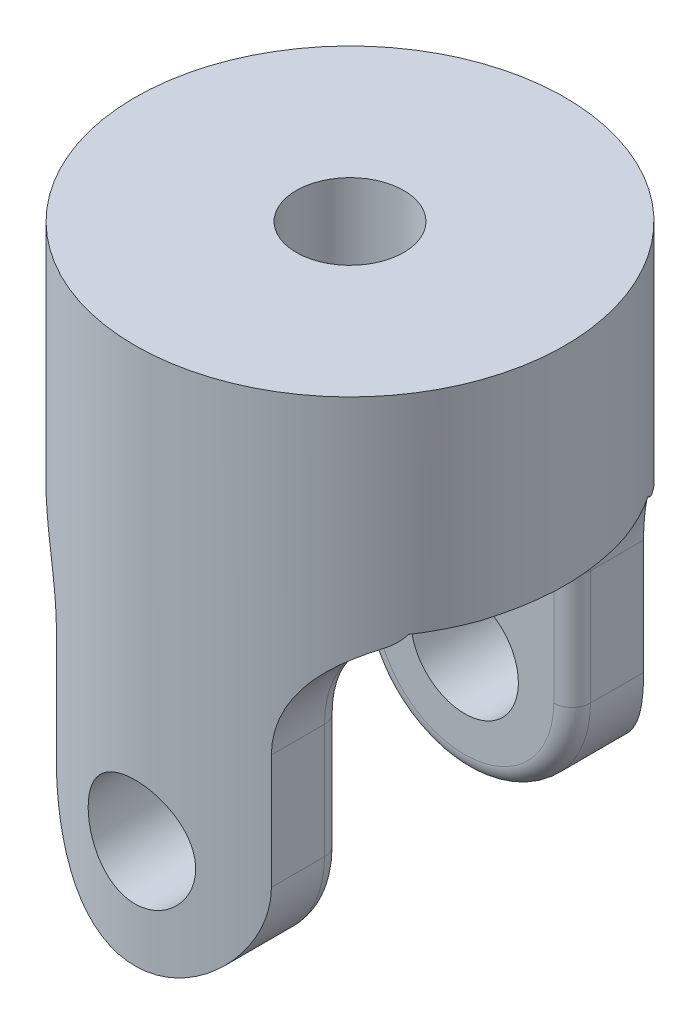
ISO-10303-21;
HEADER;
FILE_DESCRIPTION(('STEP AP214'),'2;1');
FILE_NAME('part.step','',(''),(''),'','','');
FILE_SCHEMA(('AUTOMOTIVE_DESIGN { 1 0 10303 214 1 1 1 1 }'));
ENDSEC;
DATA;
#1=APPLICATION_CONTEXT('core data for automotive mechanical design processes');
#2=APPLICATION_PROTOCOL_DEFINITION('international standard','automotive_design',2000,#1);
#3=PRODUCT_CONTEXT('',#1,'mechanical');
#4=PRODUCT('Part','Part','',(#3));
#5=PRODUCT_RELATED_PRODUCT_CATEGORY('part','',(#4));
#6=PRODUCT_DEFINITION_FORMATION('','',#4);
#7=PRODUCT_DEFINITION_CONTEXT('part definition',#1,'design');
#8=PRODUCT_DEFINITION('design','',#6,#7);
#9=PRODUCT_DEFINITION_SHAPE('','',#8);
#10=(LENGTH_UNIT() NAMED_UNIT(*) SI_UNIT(.MILLI.,.METRE.));
#11=(NAMED_UNIT(*) PLANE_ANGLE_UNIT() SI_UNIT($,.RADIAN.));
#12=(NAMED_UNIT(*) SI_UNIT($,.STERADIAN.) SOLID_ANGLE_UNIT());
#13=UNCERTAINTY_MEASURE_WITH_UNIT(LENGTH_MEASURE(1.E-05),#10,'distance_accuracy_value','');
#14=(GEOMETRIC_REPRESENTATION_CONTEXT(3) GLOBAL_UNCERTAINTY_ASSIGNED_CONTEXT((#13)) GLOBAL_UNIT_ASSIGNED_CONTEXT((#10,
#11,#12)) REPRESENTATION_CONTEXT('',''));
#15=CARTESIAN_POINT('',(0.,0.,0.));
#16=DIRECTION('',(0.,0.,1.));
#17=DIRECTION('',(1.,0.,0.));
#18=AXIS2_PLACEMENT_3D('',#15,#16,#17);
#19=CARTESIAN_POINT('',(0.,47.625,0.));
#20=DIRECTION('',(0.,-1.,0.));
#21=DIRECTION('',(0.,0.,-1.));
#22=AXIS2_PLACEMENT_3D('',#19,#20,#21);
#23=CYLINDRICAL_SURFACE('',#22,19.05);
#24=CARTESIAN_POINT('',(0.,14.2875,-19.05));
#25=CARTESIAN_POINT('',(-0.263131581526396,14.2874926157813,-19.0499955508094));
#26=CARTESIAN_POINT('',(-0.526345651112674,14.2656193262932,-19.0444938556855));
#27=CARTESIAN_POINT('',(-1.04523007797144,14.1788351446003,-19.0230796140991));
#28=CARTESIAN_POINT('',(-1.3008960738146,14.1138998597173,-19.0071611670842));
#29=CARTESIAN_POINT('',(-1.79711626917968,13.9432053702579,-18.966676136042));
#30=CARTESIAN_POINT('',(-2.03768821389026,13.837495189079,-18.9421199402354));
#31=CARTESIAN_POINT('',(-2.49768401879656,13.5884240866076,-18.886974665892));
#32=CARTESIAN_POINT('',(-2.71710716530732,13.4450618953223,-18.8563853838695));
#33=CARTESIAN_POINT('',(-3.1330961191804,13.121637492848,-18.7917903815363));
#34=CARTESIAN_POINT('',(-3.32916431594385,12.940945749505,-18.757731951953));
#35=CARTESIAN_POINT('',(-3.68855284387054,12.5493392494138,-18.6903874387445));
#36=CARTESIAN_POINT('',(-3.85186947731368,12.3384210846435,-18.6571014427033));
#37=CARTESIAN_POINT('',(-4.14345927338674,11.8884851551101,-18.5945391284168));
#38=CARTESIAN_POINT('',(-4.27117578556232,11.6490964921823,-18.5653297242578));
#39=CARTESIAN_POINT('',(-4.48436018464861,11.1513987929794,-18.514996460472));
#40=CARTESIAN_POINT('',(-4.56983482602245,10.8930927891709,-18.4938713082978));
#41=CARTESIAN_POINT('',(-4.69441160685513,10.3703643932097,-18.4626401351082));
#42=CARTESIAN_POINT('',(-4.73440845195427,10.1061682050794,-18.4523218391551));
#43=CARTESIAN_POINT('',(-4.76968113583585,9.57462979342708,-18.443237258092));
#44=CARTESIAN_POINT('',(-4.7649642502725,9.30728808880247,-18.4444690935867));
#45=CARTESIAN_POINT('',(-4.71165721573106,8.78390481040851,-18.4581547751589));
#46=CARTESIAN_POINT('',(-4.66413323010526,8.52774640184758,-18.4703359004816));
#47=CARTESIAN_POINT('',(-4.528261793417,8.02715866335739,-18.5041130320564));
#48=CARTESIAN_POINT('',(-4.43991143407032,7.78273017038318,-18.5257097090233));
#49=CARTESIAN_POINT('',(-4.22398659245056,7.30968179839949,-18.5761348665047));
#50=CARTESIAN_POINT('',(-4.09602516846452,7.08124640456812,-18.6050341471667));
#51=CARTESIAN_POINT('',(-3.80478117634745,6.6487080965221,-18.6667683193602));
#52=CARTESIAN_POINT('',(-3.64149242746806,6.44460944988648,-18.6996038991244));
#53=CARTESIAN_POINT('',(-3.27870637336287,6.06042852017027,-18.7666592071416));
#54=CARTESIAN_POINT('',(-3.07830936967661,5.88119699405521,-18.8008917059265));
#55=CARTESIAN_POINT('',(-2.64989283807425,5.55872255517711,-18.8660394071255));
#56=CARTESIAN_POINT('',(-2.42187246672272,5.41548074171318,-18.8969545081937));
#57=CARTESIAN_POINT('',(-1.94346794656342,5.16873938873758,-18.9521379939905));
#58=CARTESIAN_POINT('',(-1.69300967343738,5.06537804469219,-18.9763831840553));
#59=CARTESIAN_POINT('',(-1.17753132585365,4.90246255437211,-19.0153263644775));
#60=CARTESIAN_POINT('',(-0.912514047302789,4.84290002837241,-19.0300261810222));
#61=CARTESIAN_POINT('',(-0.382714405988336,4.77057222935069,-19.0479521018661));
#62=CARTESIAN_POINT('',(-0.118099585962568,4.75664839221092,-19.0514621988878));
#63=CARTESIAN_POINT('',(0.409679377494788,4.77281558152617,-19.0474220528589));
#64=CARTESIAN_POINT('',(0.672843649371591,4.80290264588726,-19.0398728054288));
#65=CARTESIAN_POINT('',(1.18622530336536,4.90528263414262,-19.0147442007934));
#66=CARTESIAN_POINT('',(1.43657675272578,4.97694351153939,-18.9973151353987));
#67=CARTESIAN_POINT('',(1.92169190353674,5.15971499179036,-18.9543914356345));
#68=CARTESIAN_POINT('',(2.15645402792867,5.27082957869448,-18.928895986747));
#69=CARTESIAN_POINT('',(2.60833595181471,5.5315997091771,-18.8719875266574));
#70=CARTESIAN_POINT('',(2.82506877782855,5.6819041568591,-18.8404775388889));
#71=CARTESIAN_POINT('',(3.23064699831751,6.015957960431,-18.7751881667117));
#72=CARTESIAN_POINT('',(3.41948756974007,6.19971308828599,-18.7414083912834));
#73=CARTESIAN_POINT('',(3.76869505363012,6.60083122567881,-18.6743643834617));
#74=CARTESIAN_POINT('',(3.92824927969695,6.81890845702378,-18.6411331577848));
#75=CARTESIAN_POINT('',(4.20849665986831,7.27942611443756,-18.5798738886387));
#76=CARTESIAN_POINT('',(4.32919153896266,7.5218654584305,-18.5518456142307));
#77=CARTESIAN_POINT('',(4.5273957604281,8.02292566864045,-18.5044745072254));
#78=CARTESIAN_POINT('',(4.60516095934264,8.28144021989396,-18.4850803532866));
#79=CARTESIAN_POINT('',(4.71597247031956,8.80843310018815,-18.457124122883));
#80=CARTESIAN_POINT('',(4.7490285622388,9.0769092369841,-18.4485596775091));
#81=CARTESIAN_POINT('',(4.76897252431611,9.6079342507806,-18.4434131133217));
#82=CARTESIAN_POINT('',(4.75715932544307,9.87043185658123,-18.4464938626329));
#83=CARTESIAN_POINT('',(4.69067285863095,10.3895648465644,-18.4635111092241));
#84=CARTESIAN_POINT('',(4.63600045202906,10.6462003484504,-18.4774473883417));
#85=CARTESIAN_POINT('',(4.48605693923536,11.1449118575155,-18.5144175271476));
#86=CARTESIAN_POINT('',(4.39102945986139,11.3870654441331,-18.5373967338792));
#87=CARTESIAN_POINT('',(4.1632661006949,11.8521650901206,-18.5898712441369));
#88=CARTESIAN_POINT('',(4.03052499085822,12.0751084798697,-18.6193674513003));
#89=CARTESIAN_POINT('',(3.72703010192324,12.5017359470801,-18.6825138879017));
#90=CARTESIAN_POINT('',(3.5553750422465,12.7047659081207,-18.7162524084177));
#91=CARTESIAN_POINT('',(3.18068125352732,13.0795618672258,-18.7835548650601));
#92=CARTESIAN_POINT('',(2.97763508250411,13.2513204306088,-18.8171187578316));
#93=CARTESIAN_POINT('',(2.54148458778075,13.5617309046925,-18.8810155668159));
#94=CARTESIAN_POINT('',(2.30790249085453,13.6997268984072,-18.911278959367));
#95=CARTESIAN_POINT('',(1.82011973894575,13.9342731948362,-18.9644313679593));
#96=CARTESIAN_POINT('',(1.56593401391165,14.0308531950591,-18.9873256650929));
#97=CARTESIAN_POINT('',(1.09350255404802,14.1654905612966,-19.0197758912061));
#98=CARTESIAN_POINT('',(0.87750704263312,14.2111451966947,-19.031032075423));
#99=CARTESIAN_POINT('',(0.441026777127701,14.2721518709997,-19.0461457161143));
#100=CARTESIAN_POINT('',(0.220542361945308,14.2875061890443,-19.0500037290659));
#101=CARTESIAN_POINT('',(0.,14.2875,-19.05));
#102=B_SPLINE_CURVE_WITH_KNOTS('',3,(#24,#25,#26,#27,#28,#29,#30,#31,#32,#33,#34,#35,#36,#37,
#38,#39,#40,#41,#42,#43,#44,#45,#46,#47,#48,#49,#50,#51,#52,#53,#54,#55,#56,#57,#58,#59,#60,#61,
#62,#63,#64,#65,#66,#67,#68,#69,#70,#71,#72,#73,#74,#75,#76,#77,#78,#79,#80,#81,#82,#83,#84,#85,
#86,#87,#88,#89,#90,#91,#92,#93,#94,#95,#96,#97,#98,#99,#100,#101),.UNSPECIFIED.,.T.,.F.,(4,2,2,
2,2,2,2,2,2,2,2,2,2,2,2,2,2,2,2,2,2,2,2,2,2,2,2,2,2,2,2,2,2,2,2,2,2,2,4),(0.,0.78858653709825,
1.57762015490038,2.36570806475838,3.15382256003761,3.95650832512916,4.75928466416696,
5.57398705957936,6.38855914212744,7.18681236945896,7.98493571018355,8.76371428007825,
9.54254833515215,10.3292442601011,11.1160779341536,11.9253476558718,12.7346420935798,
13.5467162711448,14.3586350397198,15.1497763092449,15.940846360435,16.7201937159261,
17.4996197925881,18.2928764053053,19.08627002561,19.8991381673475,20.7119702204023,
21.5199040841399,22.3276611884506,23.1122150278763,23.8967531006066,24.6766207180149,
25.4565965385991,26.2569190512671,27.0574315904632,27.8724418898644,28.6868668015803,
29.3478662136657,30.008815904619),.UNSPECIFIED.);
#103=CARTESIAN_POINT('',(0.,14.2875,-19.05));
#104=VERTEX_POINT('',#103);
#105=EDGE_CURVE('E245',#104,#104,#102,.T.);
#106=ORIENTED_EDGE('',*,*,#105,.T.);
#107=EDGE_LOOP('',(#106));
#108=FACE_BOUND('',#107,.T.);
#109=CARTESIAN_POINT('',(4.7625,9.525,18.4450831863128));
#110=CARTESIAN_POINT('',(4.7624925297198,9.26201331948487,18.4450882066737));
#111=CARTESIAN_POINT('',(4.74064249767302,8.99894396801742,18.4507690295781));
#112=CARTESIAN_POINT('',(4.65395905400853,8.48035976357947,18.4728204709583));
#113=CARTESIAN_POINT('',(4.58910062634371,8.22484939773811,18.4891973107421));
#114=CARTESIAN_POINT('',(4.41863073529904,7.72895925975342,18.5306727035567));
#115=CARTESIAN_POINT('',(4.31307188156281,7.48856041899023,18.5557599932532));
#116=CARTESIAN_POINT('',(4.06435777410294,7.02885782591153,18.6118155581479));
#117=CARTESIAN_POINT('',(3.92120092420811,6.80955496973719,18.6427840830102));
#118=CARTESIAN_POINT('',(3.59798955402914,6.39344356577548,18.7078756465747));
#119=CARTESIAN_POINT('',(3.41725927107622,6.19716769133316,18.7420490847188));
#120=CARTESIAN_POINT('',(3.02548683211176,5.83737454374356,18.8092627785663));
#121=CARTESIAN_POINT('',(2.81444184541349,5.67386033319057,18.8423029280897));
#122=CARTESIAN_POINT('',(2.36438160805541,5.38205273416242,18.9040849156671));
#123=CARTESIAN_POINT('',(2.12501716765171,5.25428263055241,18.9327603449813));
#124=CARTESIAN_POINT('',(1.62737136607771,5.04099262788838,18.98200696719));
#125=CARTESIAN_POINT('',(1.36909280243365,4.95546649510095,19.0025793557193));
#126=CARTESIAN_POINT('',(0.846503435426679,4.8307983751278,19.0329456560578));
#127=CARTESIAN_POINT('',(0.582420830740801,4.79075182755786,19.0429494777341));
#128=CARTESIAN_POINT('',(0.0511089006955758,4.75534028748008,19.0517829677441));
#129=CARTESIAN_POINT('',(-0.216119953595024,4.75996868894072,19.0506142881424));
#130=CARTESIAN_POINT('',(-0.739865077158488,4.81312508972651,19.0373907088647));
#131=CARTESIAN_POINT('',(-0.996487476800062,4.86067669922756,19.0255779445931));
#132=CARTESIAN_POINT('',(-1.4979884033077,4.99676026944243,18.992675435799));
#133=CARTESIAN_POINT('',(-1.74286630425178,5.08529441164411,18.9715851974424));
#134=CARTESIAN_POINT('',(-2.21649942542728,5.30161989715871,18.9221270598));
#135=CARTESIAN_POINT('',(-2.44508897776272,5.42975872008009,18.8936951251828));
#136=CARTESIAN_POINT('',(-2.87786265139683,5.72139256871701,18.8326376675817));
#137=CARTESIAN_POINT('',(-3.08204251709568,5.88489374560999,18.8000114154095));
#138=CARTESIAN_POINT('',(-3.46602384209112,6.24784515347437,18.733078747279));
#139=CARTESIAN_POINT('',(-3.6450159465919,6.44814856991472,18.6987507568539));
#140=CARTESIAN_POINT('',(-3.96704999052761,6.87628794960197,18.6330915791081));
#141=CARTESIAN_POINT('',(-4.11009024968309,7.10412519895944,18.6017605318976));
#142=CARTESIAN_POINT('',(-4.35667846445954,7.58245251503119,18.5455654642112));
#143=CARTESIAN_POINT('',(-4.46003156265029,7.8330470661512,18.5207335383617));
#144=CARTESIAN_POINT('',(-4.6228902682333,8.34882531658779,18.4807600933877));
#145=CARTESIAN_POINT('',(-4.68240525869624,8.61400588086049,18.4656165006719));
#146=CARTESIAN_POINT('',(-4.75455546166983,9.14392285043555,18.4471695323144));
#147=CARTESIAN_POINT('',(-4.76838735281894,9.40848599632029,18.4435639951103));
#148=CARTESIAN_POINT('',(-4.75205486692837,9.93614078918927,18.4477788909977));
#149=CARTESIAN_POINT('',(-4.72189453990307,10.1992325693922,18.4555982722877));
#150=CARTESIAN_POINT('',(-4.61948300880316,10.7120326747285,18.4814924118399));
#151=CARTESIAN_POINT('',(-4.54792855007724,10.9618895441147,18.4993972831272));
#152=CARTESIAN_POINT('',(-4.36553244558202,11.4460619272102,18.5432836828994));
#153=CARTESIAN_POINT('',(-4.25468614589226,11.6803755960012,18.5692661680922));
#154=CARTESIAN_POINT('',(-3.99434812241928,12.1318806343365,18.6270164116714));
#155=CARTESIAN_POINT('',(-3.84414094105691,12.3486459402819,18.6588876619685));
#156=CARTESIAN_POINT('',(-3.51024964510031,12.7543338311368,18.7245704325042));
#157=CARTESIAN_POINT('',(-3.32656002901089,12.9432518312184,18.7583822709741));
#158=CARTESIAN_POINT('',(-2.92542620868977,13.2927300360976,18.8251605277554));
#159=CARTESIAN_POINT('',(-2.70725242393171,13.4524624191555,18.8580846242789));
#160=CARTESIAN_POINT('',(-2.24648402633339,13.7330228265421,18.9185019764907));
#161=CARTESIAN_POINT('',(-2.00389068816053,13.8538528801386,18.9459955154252));
#162=CARTESIAN_POINT('',(-1.50284593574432,14.0521296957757,18.9922807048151));
#163=CARTESIAN_POINT('',(-1.24452402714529,14.1298884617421,19.0111347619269));
#164=CARTESIAN_POINT('',(-0.717945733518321,14.240751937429,19.0382898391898));
#165=CARTESIAN_POINT('',(-0.449691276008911,14.2738652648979,19.0465928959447));
#166=CARTESIAN_POINT('',(0.0813602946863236,14.2940131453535,19.0516273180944));
#167=CARTESIAN_POINT('',(0.344108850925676,14.2822693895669,19.0486654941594));
#168=CARTESIAN_POINT('',(0.863762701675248,14.2158347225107,19.0321833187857));
#169=CARTESIAN_POINT('',(1.12066816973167,14.1611450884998,19.0186632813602));
#170=CARTESIAN_POINT('',(1.62006455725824,14.0110263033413,18.9826312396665));
#171=CARTESIAN_POINT('',(1.86262563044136,13.9158180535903,18.9601680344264));
#172=CARTESIAN_POINT('',(2.32846746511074,13.6875651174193,18.908615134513));
#173=CARTESIAN_POINT('',(2.55174579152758,13.5545156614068,18.8795246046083));
#174=CARTESIAN_POINT('',(2.97847668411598,13.2506311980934,18.8169827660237));
#175=CARTESIAN_POINT('',(3.18132613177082,13.0789673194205,18.7834436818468));
#176=CARTESIAN_POINT('',(3.55575403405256,12.7043361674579,18.7161796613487));
#177=CARTESIAN_POINT('',(3.72732454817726,12.5013609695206,18.6824546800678));
#178=CARTESIAN_POINT('',(4.0374666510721,12.0653107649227,18.6179210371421));
#179=CARTESIAN_POINT('',(4.1753628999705,11.831744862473,18.5871785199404));
#180=CARTESIAN_POINT('',(4.4097268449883,11.3440107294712,18.5329808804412));
#181=CARTESIAN_POINT('',(4.50622468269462,11.0898576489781,18.5095204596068));
#182=CARTESIAN_POINT('',(4.6406872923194,10.6176269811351,18.4762096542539));
#183=CARTESIAN_POINT('',(4.68626747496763,10.401808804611,18.4646250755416));
#184=CARTESIAN_POINT('',(4.74717566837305,9.96567951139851,18.4490600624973));
#185=CARTESIAN_POINT('',(4.76250625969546,9.74536877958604,18.4450789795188));
#186=CARTESIAN_POINT('',(4.7625,9.525,18.4450831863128));
#187=B_SPLINE_CURVE_WITH_KNOTS('',3,(#109,#110,#111,#112,#113,#114,#115,#116,#117,#118,#119,
#120,#121,#122,#123,#124,#125,#126,#127,#128,#129,#130,#131,#132,#133,#134,#135,#136,#137,#138,
#139,#140,#141,#142,#143,#144,#145,#146,#147,#148,#149,#150,#151,#152,#153,#154,#155,#156,#157,
#158,#159,#160,#161,#162,#163,#164,#165,#166,#167,#168,#169,#170,#171,#172,#173,#174,#175,#176,
#177,#178,#179,#180,#181,#182,#183,#184,#185,#186),.UNSPECIFIED.,.T.,.F.,(4,2,2,2,2,2,2,2,2,2,2,
2,2,2,2,2,2,2,2,2,2,2,2,2,2,2,2,2,2,2,2,2,2,2,2,2,2,2,4),(0.,0.788150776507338,1.57676038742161,
2.36435403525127,3.15198112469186,3.95523632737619,4.75856658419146,5.57310600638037,
6.3875251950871,7.18544570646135,7.98324823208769,8.76334790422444,9.54348910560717,
10.3306792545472,11.1180064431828,11.9266423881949,12.7353161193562,13.5479110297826,
14.3603319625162,15.1512950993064,15.9421854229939,16.7201355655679,17.4981778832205,
18.2914832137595,19.0849190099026,19.8982075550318,20.7114536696,21.5187289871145,
22.3258484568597,23.1111446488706,23.896417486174,24.677462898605,25.4586067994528,
26.258464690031,27.0585253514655,27.8735118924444,28.6879040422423,29.3483886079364,
30.0088168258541),.UNSPECIFIED.);
#188=CARTESIAN_POINT('',(4.7625,9.525,18.4450831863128));
#189=VERTEX_POINT('',#188);
#190=EDGE_CURVE('E249',#189,#189,#187,.T.);
#191=ORIENTED_EDGE('',*,*,#190,.T.);
#192=EDGE_LOOP('',(#191));
#193=FACE_BOUND('',#192,.T.);
#194=CARTESIAN_POINT('',(0.,47.625,0.));
#195=DIRECTION('',(0.,1.,0.));
#196=DIRECTION('',(0.,0.,1.));
#197=AXIS2_PLACEMENT_3D('',#194,#195,#196);
#198=CIRCLE('',#197,19.05);
#199=CARTESIAN_POINT('',(0.,47.625,19.05));
#200=VERTEX_POINT('',#199);
#201=EDGE_CURVE('E252',#200,#200,#198,.T.);
#202=ORIENTED_EDGE('',*,*,#201,.F.);
#203=EDGE_LOOP('',(#202));
#204=FACE_BOUND('',#203,.T.);
#205=CARTESIAN_POINT('',(0.,29.1452388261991,0.));
#206=DIRECTION('',(0.,-1.,0.));
#207=DIRECTION('',(0.,0.,-1.));
#208=AXIS2_PLACEMENT_3D('',#205,#206,#207);
#209=CIRCLE('',#208,19.05);
#210=CARTESIAN_POINT('',(-15.8045091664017,29.1452388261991,10.6357881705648));
#211=VERTEX_POINT('',#210);
#212=CARTESIAN_POINT('',(-17.9411689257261,29.1452388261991,6.40444826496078));
#213=VERTEX_POINT('',#212);
#214=EDGE_CURVE('E182',#211,#213,#209,.T.);
#215=ORIENTED_EDGE('',*,*,#214,.F.);
#216=CARTESIAN_POINT('',(-15.8045091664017,29.1452388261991,10.6357881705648));
#217=CARTESIAN_POINT('',(-15.7780681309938,29.0946170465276,10.6750805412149));
#218=CARTESIAN_POINT('',(-15.7503808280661,29.0459076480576,10.7159048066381));
#219=CARTESIAN_POINT('',(-15.6927265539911,28.9523121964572,10.800158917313));
#220=CARTESIAN_POINT('',(-15.6627613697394,28.9074232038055,10.8435867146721));
#221=CARTESIAN_POINT('',(-15.5707593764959,28.7798361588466,10.9756682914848));
#222=CARTESIAN_POINT('',(-15.5057022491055,28.7025004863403,11.0674874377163));
#223=CARTESIAN_POINT('',(-15.4017758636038,28.5961638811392,11.2112221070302));
#224=CARTESIAN_POINT('',(-15.3653620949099,28.5618065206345,11.2610876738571));
#225=CARTESIAN_POINT('',(-15.2908203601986,28.4970323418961,11.3620968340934));
#226=CARTESIAN_POINT('',(-15.252692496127,28.4666152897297,11.4132403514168));
#227=CARTESIAN_POINT('',(-15.1741618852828,28.409298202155,11.5174494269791));
#228=CARTESIAN_POINT('',(-15.1337308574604,28.3824697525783,11.5705329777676));
#229=CARTESIAN_POINT('',(-15.0513365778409,28.3331349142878,11.677514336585));
#230=CARTESIAN_POINT('',(-15.0093732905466,28.3106286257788,11.731412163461));
#231=CARTESIAN_POINT('',(-14.9667007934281,28.2903641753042,11.7856));
#232=B_SPLINE_CURVE_WITH_KNOTS('',3,(#216,#217,#218,#219,#220,#221,#222,#223,#224,#225,#226,
#227,#228,#229,#230,#231),.UNSPECIFIED.,.F.,.F.,(4,2,2,2,2,2,2,4),(0.,0.207821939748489,
0.415482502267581,0.823732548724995,1.03561238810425,1.247479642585,1.46308796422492,
1.67870128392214),.UNSPECIFIED.);
#233=CARTESIAN_POINT('',(-14.9667007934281,28.2903641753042,11.7856));
#234=VERTEX_POINT('',#233);
#235=EDGE_CURVE('E426',#211,#234,#232,.T.);
#236=ORIENTED_EDGE('',*,*,#235,.T.);
#237=CARTESIAN_POINT('',(-9.525,19.685,16.4977839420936));
#238=CARTESIAN_POINT('',(-9.52496088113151,19.918350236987,16.4977688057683));
#239=CARTESIAN_POINT('',(-9.53357353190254,20.1516967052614,16.4928328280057));
#240=CARTESIAN_POINT('',(-9.56782146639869,20.6166980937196,16.4730087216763));
#241=CARTESIAN_POINT('',(-9.59345572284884,20.8483531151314,16.4581211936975));
#242=CARTESIAN_POINT('',(-9.66141942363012,21.3080009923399,16.4183108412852));
#243=CARTESIAN_POINT('',(-9.70372594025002,21.5359984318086,16.3934017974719));
#244=CARTESIAN_POINT('',(-9.80447669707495,21.9870210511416,16.3333461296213));
#245=CARTESIAN_POINT('',(-9.86292069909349,22.2100463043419,16.2981996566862));
#246=CARTESIAN_POINT('',(-9.99521577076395,22.6496636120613,16.217402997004));
#247=CARTESIAN_POINT('',(-10.0690752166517,22.8662520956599,16.1717470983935));
#248=CARTESIAN_POINT('',(-10.2311827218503,23.2913603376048,16.0696785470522));
#249=CARTESIAN_POINT('',(-10.3194309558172,23.4998799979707,16.0132657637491));
#250=CARTESIAN_POINT('',(-10.5090589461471,23.9073731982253,15.8894615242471));
#251=CARTESIAN_POINT('',(-10.6104339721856,24.1063501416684,15.8220740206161));
#252=CARTESIAN_POINT('',(-10.8249101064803,24.4935871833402,15.676116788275));
#253=CARTESIAN_POINT('',(-10.9380111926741,24.6818473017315,15.597547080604));
#254=CARTESIAN_POINT('',(-11.1750060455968,25.0476354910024,15.4286429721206));
#255=CARTESIAN_POINT('',(-11.2989577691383,25.2250961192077,15.3382439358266));
#256=CARTESIAN_POINT('',(-11.5553164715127,25.5672655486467,15.1460495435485));
#257=CARTESIAN_POINT('',(-11.6877234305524,25.7319743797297,15.0442542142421));
#258=CARTESIAN_POINT('',(-11.9591574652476,26.0480960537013,14.8293967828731));
#259=CARTESIAN_POINT('',(-12.0981857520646,26.1995064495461,14.7163326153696));
#260=CARTESIAN_POINT('',(-12.3809708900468,26.488718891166,14.4792302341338));
#261=CARTESIAN_POINT('',(-12.5247282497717,26.6265194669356,14.3551908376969));
#262=CARTESIAN_POINT('',(-12.8240785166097,26.8965620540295,14.0885806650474));
#263=CARTESIAN_POINT('',(-12.9798547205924,27.0279377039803,13.945338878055));
#264=CARTESIAN_POINT('',(-13.292575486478,27.2756182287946,13.6475843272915));
#265=CARTESIAN_POINT('',(-13.4495200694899,27.3919228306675,13.4930713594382));
#266=CARTESIAN_POINT('',(-13.7627279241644,27.6100750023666,13.1734537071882));
#267=CARTESIAN_POINT('',(-13.91899104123,27.7119194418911,13.0083467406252));
#268=CARTESIAN_POINT('',(-14.2291584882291,27.9019462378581,12.6683290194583));
#269=CARTESIAN_POINT('',(-14.3830623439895,27.9901258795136,12.4934163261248));
#270=CARTESIAN_POINT('',(-14.7634251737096,28.1948863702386,12.0444336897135));
#271=CARTESIAN_POINT('',(-14.9875078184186,28.3034922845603,11.7646791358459));
#272=CARTESIAN_POINT('',(-15.4232003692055,28.4957157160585,11.1874194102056));
#273=CARTESIAN_POINT('',(-15.6348051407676,28.5793230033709,10.8899070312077));
#274=CARTESIAN_POINT('',(-16.0431146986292,28.7255421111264,10.2789237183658));
#275=CARTESIAN_POINT('',(-16.2397846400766,28.7881059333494,9.96541815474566));
#276=CARTESIAN_POINT('',(-16.615638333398,28.8957388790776,9.32528378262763));
#277=CARTESIAN_POINT('',(-16.7948218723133,28.9408077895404,8.99865481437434));
#278=CARTESIAN_POINT('',(-17.1918461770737,29.029905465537,8.22145899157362));
#279=CARTESIAN_POINT('',(-17.4021973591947,29.0684013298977,7.76641658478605));
#280=CARTESIAN_POINT('',(-17.786699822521,29.1278564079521,6.84014068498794));
#281=CARTESIAN_POINT('',(-17.9608394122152,29.1488099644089,6.36890201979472));
#282=CARTESIAN_POINT('',(-18.2714417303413,29.1794105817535,5.41378881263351));
#283=CARTESIAN_POINT('',(-18.4079009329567,29.1890565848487,4.92991309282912));
#284=CARTESIAN_POINT('',(-18.6421466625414,29.2019870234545,3.95287775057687));
#285=CARTESIAN_POINT('',(-18.7399368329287,29.2052720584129,3.45971900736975));
#286=CARTESIAN_POINT('',(-18.897358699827,29.2091078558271,2.46008138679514));
#287=CARTESIAN_POINT('',(-18.9564226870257,29.2096187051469,1.95351291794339));
#288=CARTESIAN_POINT('',(-19.033752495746,29.2100647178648,0.93726372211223));
#289=CARTESIAN_POINT('',(-19.0520174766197,29.209999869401,0.427582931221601));
#290=CARTESIAN_POINT('',(-19.0476285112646,29.2100001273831,-0.59182555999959));
#291=CARTESIAN_POINT('',(-19.0249568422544,29.2100652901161,-1.10155318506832));
#292=CARTESIAN_POINT('',(-18.9388075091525,29.2094475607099,-2.11754548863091));
#293=CARTESIAN_POINT('',(-18.8753295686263,29.2087646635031,-2.62381014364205));
#294=CARTESIAN_POINT('',(-18.7036160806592,29.2041086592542,-3.65580332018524));
#295=CARTESIAN_POINT('',(-18.5932233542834,29.1999661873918,-4.18117378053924));
#296=CARTESIAN_POINT('',(-18.3285057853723,29.1835599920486,-5.22073652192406));
#297=CARTESIAN_POINT('',(-18.1741722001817,29.1712946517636,-5.73492655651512));
#298=CARTESIAN_POINT('',(-17.8230306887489,29.1322930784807,-6.74751648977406));
#299=CARTESIAN_POINT('',(-17.6262637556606,29.1055707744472,-7.24593109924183));
#300=CARTESIAN_POINT('',(-17.1921907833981,29.0296619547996,-8.22291578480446));
#301=CARTESIAN_POINT('',(-16.9549063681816,28.9804873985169,-8.70149627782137));
#302=CARTESIAN_POINT('',(-16.5317482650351,28.8726944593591,-9.47232063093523));
#303=CARTESIAN_POINT('',(-16.356505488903,28.8232353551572,-9.77172744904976));
#304=CARTESIAN_POINT('',(-15.9915321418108,28.7076409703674,-10.3582119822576));
#305=CARTESIAN_POINT('',(-15.8018055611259,28.6415102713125,-10.6452930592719));
#306=CARTESIAN_POINT('',(-15.4100602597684,28.4895738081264,-11.2048655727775));
#307=CARTESIAN_POINT('',(-15.2080616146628,28.4037995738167,-11.4773795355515));
#308=CARTESIAN_POINT('',(-14.794100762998,28.2093882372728,-12.0062371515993));
#309=CARTESIAN_POINT('',(-14.5821407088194,28.1007560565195,-12.2625842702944));
#310=CARTESIAN_POINT('',(-14.1961331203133,27.8828084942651,-12.7059055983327));
#311=CARTESIAN_POINT('',(-14.0232896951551,27.7782615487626,-12.8962780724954));
#312=CARTESIAN_POINT('',(-13.6756323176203,27.5516907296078,-13.2643740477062));
#313=CARTESIAN_POINT('',(-13.500818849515,27.4296710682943,-13.4421005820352));
#314=CARTESIAN_POINT('',(-13.1516762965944,27.1671845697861,-13.7838888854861));
#315=CARTESIAN_POINT('',(-12.9773471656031,27.0267195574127,-13.947952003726));
#316=CARTESIAN_POINT('',(-12.6319391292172,26.726763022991,-14.2615225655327));
#317=CARTESIAN_POINT('',(-12.4608602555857,26.5672713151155,-14.4110298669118));
#318=CARTESIAN_POINT('',(-12.1237135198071,26.2279198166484,-14.6958204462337));
#319=CARTESIAN_POINT('',(-11.957692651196,26.0479167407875,-14.8309890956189));
#320=CARTESIAN_POINT('',(-11.6351953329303,25.6689938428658,-15.0853214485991));
#321=CARTESIAN_POINT('',(-11.4787191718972,25.4700734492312,-15.2044846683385));
#322=CARTESIAN_POINT('',(-11.1784747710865,25.0543983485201,-15.4265708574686));
#323=CARTESIAN_POINT('',(-11.0347050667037,24.8376457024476,-15.5294956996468));
#324=CARTESIAN_POINT('',(-10.7628059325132,24.3878782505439,-15.7191604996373));
#325=CARTESIAN_POINT('',(-10.6346741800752,24.154865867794,-15.8059028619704));
#326=CARTESIAN_POINT('',(-10.4115375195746,23.7046522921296,-15.9536199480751));
#327=CARTESIAN_POINT('',(-10.3143937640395,23.4891174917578,-16.0164604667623));
#328=CARTESIAN_POINT('',(-10.1355425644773,23.04871010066,-16.1302361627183));
#329=CARTESIAN_POINT('',(-10.0538339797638,22.8238382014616,-16.181172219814));
#330=CARTESIAN_POINT('',(-9.90713729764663,22.3666546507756,-16.2714028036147));
#331=CARTESIAN_POINT('',(-9.84213485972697,22.1343495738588,-16.3107073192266));
#332=CARTESIAN_POINT('',(-9.72972257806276,21.6640173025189,-16.3780123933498));
#333=CARTESIAN_POINT('',(-9.6823065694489,21.4259921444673,-16.4060169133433));
#334=CARTESIAN_POINT('',(-9.60449707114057,20.9383691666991,-16.4516946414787));
#335=CARTESIAN_POINT('',(-9.57468865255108,20.6886433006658,-16.4690135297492));
#336=CARTESIAN_POINT('',(-9.54488066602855,20.3127872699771,-16.48629321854));
#337=CARTESIAN_POINT('',(-9.5374287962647,20.1873921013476,-16.4906033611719));
#338=CARTESIAN_POINT('',(-9.52748802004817,19.9363374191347,-16.4963477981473));
#339=CARTESIAN_POINT('',(-9.52499919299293,19.8106779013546,-16.4977820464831));
#340=CARTESIAN_POINT('',(-9.525,19.685,-16.4977839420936));
#341=B_SPLINE_CURVE_WITH_KNOTS('',3,(#237,#238,#239,#240,#241,#242,#243,#244,#245,#246,#247,
#248,#249,#250,#251,#252,#253,#254,#255,#256,#257,#258,#259,#260,#261,#262,#263,#264,#265,#266,
#267,#268,#269,#270,#271,#272,#273,#274,#275,#276,#277,#278,#279,#280,#281,#282,#283,#284,#285,
#286,#287,#288,#289,#290,#291,#292,#293,#294,#295,#296,#297,#298,#299,#300,#301,#302,#303,#304,
#305,#306,#307,#308,#309,#310,#311,#312,#313,#314,#315,#316,#317,#318,#319,#320,#321,#322,#323,
#324,#325,#326,#327,#328,#329,#330,#331,#332,#333,#334,#335,#336,#337,#338,#339,#340),
.UNSPECIFIED.,.F.,.F.,(4,2,2,2,2,2,2,2,2,2,2,2,2,2,2,2,2,2,2,2,2,2,2,2,2,2,2,2,2,2,2,2,2,2,2,2,
2,2,2,2,2,2,2,2,2,2,2,2,2,2,2,4),(0.,0.699834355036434,1.39962647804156,2.09845958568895,
2.79728237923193,3.49648588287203,4.19569787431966,4.89465859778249,5.59361800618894,
6.29656980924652,6.99951996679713,7.70259920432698,8.40575429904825,9.1522568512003,
9.898772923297,10.6454503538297,11.3922759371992,12.514141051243,13.6364646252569,
14.7613310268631,15.886211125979,17.3924586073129,18.899191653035,20.40606563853,
21.9127976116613,23.4411511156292,24.9695361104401,26.4985829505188,28.0276401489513,
29.6362655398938,31.2452112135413,32.852609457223,34.4591525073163,35.50965675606,
36.5598726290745,37.6084144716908,38.6567307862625,39.4886840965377,40.3204371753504,
41.1521080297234,41.9837870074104,42.8216802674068,43.6595988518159,44.4974207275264,
45.3351180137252,46.0680642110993,46.8009562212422,47.5332170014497,48.2652208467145,
49.02034913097,49.3973072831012,49.7742714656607),.UNSPECIFIED.);
#342=CARTESIAN_POINT('',(-9.525,19.685,16.4977839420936));
#343=VERTEX_POINT('',#342);
#344=EDGE_CURVE('E259',#343,#234,#341,.T.);
#345=ORIENTED_EDGE('',*,*,#344,.F.);
#346=DIRECTION('',(0.,-1.,0.));
#347=VECTOR('',#346,1.);
#348=CARTESIAN_POINT('',(-9.52499999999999,47.625,16.4977839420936));
#349=LINE('',#348,#347);
#350=CARTESIAN_POINT('',(-9.525,9.525,16.4977839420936));
#351=VERTEX_POINT('',#350);
#352=EDGE_CURVE('E188',#351,#343,#349,.F.);
#353=ORIENTED_EDGE('',*,*,#352,.F.);
#354=CARTESIAN_POINT('',(-9.525,9.525,16.4977839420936));
#355=CARTESIAN_POINT('',(-9.52500093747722,9.40027257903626,16.4977810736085));
#356=CARTESIAN_POINT('',(-9.5225495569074,9.27556275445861,16.4991989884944));
#357=CARTESIAN_POINT('',(-9.51275833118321,9.02640408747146,16.504847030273));
#358=CARTESIAN_POINT('',(-9.50541869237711,8.90195523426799,16.5090770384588));
#359=CARTESIAN_POINT('',(-9.47610793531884,8.52953393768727,16.5259318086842));
#360=CARTESIAN_POINT('',(-9.4468449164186,8.28227418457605,16.5427214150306));
#361=CARTESIAN_POINT('',(-9.36949132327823,7.79316834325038,16.5866536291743));
#362=CARTESIAN_POINT('',(-9.32150961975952,7.55129934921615,16.6137363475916));
#363=CARTESIAN_POINT('',(-9.20730560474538,7.07314911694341,16.6772985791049));
#364=CARTESIAN_POINT('',(-9.14108119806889,6.83686852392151,16.7137791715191));
#365=CARTESIAN_POINT('',(-8.99129510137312,6.37194751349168,16.7948306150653));
#366=CARTESIAN_POINT('',(-8.90777526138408,6.14329017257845,16.8393819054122));
#367=CARTESIAN_POINT('',(-8.72407711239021,5.69420111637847,16.9352799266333));
#368=CARTESIAN_POINT('',(-8.62389244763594,5.47377257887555,16.9866292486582));
#369=CARTESIAN_POINT('',(-8.29930376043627,4.8260140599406,17.1488381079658));
#370=CARTESIAN_POINT('',(-8.05095104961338,4.41247529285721,17.2678097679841));
#371=CARTESIAN_POINT('',(-7.47383610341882,3.5973692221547,17.5257462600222));
#372=CARTESIAN_POINT('',(-7.14015861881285,3.19954734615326,17.6655504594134));
#373=CARTESIAN_POINT('',(-6.59457427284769,2.64718480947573,17.8732248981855));
#374=CARTESIAN_POINT('',(-6.405096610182,2.47038257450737,17.9421446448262));
#375=CARTESIAN_POINT('',(-6.01181385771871,2.13237428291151,18.0777156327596));
#376=CARTESIAN_POINT('',(-5.80800671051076,1.97117047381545,18.1443665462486));
#377=CARTESIAN_POINT('',(-5.37278064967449,1.65505544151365,18.2781569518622));
#378=CARTESIAN_POINT('',(-5.14042653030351,1.5013140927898,18.3450225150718));
#379=CARTESIAN_POINT('',(-4.66194023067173,1.21417930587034,18.4724136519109));
#380=CARTESIAN_POINT('',(-4.41581396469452,1.08077722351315,18.5329419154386));
#381=CARTESIAN_POINT('',(-3.9113048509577,0.835583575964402,18.6459377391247));
#382=CARTESIAN_POINT('',(-3.6529249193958,0.723786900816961,18.6984072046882));
#383=CARTESIAN_POINT('',(-3.12571930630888,0.52305375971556,18.7937250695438));
#384=CARTESIAN_POINT('',(-2.85689473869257,0.434114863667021,18.8365744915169));
#385=CARTESIAN_POINT('',(-2.33040396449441,0.285723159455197,18.9086545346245));
#386=CARTESIAN_POINT('',(-2.07330466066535,0.224622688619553,18.9386372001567));
#387=CARTESIAN_POINT('',(-1.55394863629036,0.123892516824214,18.9883061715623));
#388=CARTESIAN_POINT('',(-1.29169214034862,0.0842618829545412,19.0079929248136));
#389=CARTESIAN_POINT('',(-0.764329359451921,0.0270138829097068,19.0364912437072));
#390=CARTESIAN_POINT('',(-0.499224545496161,0.0093856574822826,19.0453081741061));
#391=CARTESIAN_POINT('',(0.0316607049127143,-0.00364684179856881,19.0518227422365));
#392=CARTESIAN_POINT('',(0.297441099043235,0.000947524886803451,19.0495210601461));
#393=CARTESIAN_POINT('',(0.804260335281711,0.0309220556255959,19.0345541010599));
#394=CARTESIAN_POINT('',(1.04543822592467,0.0544573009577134,19.0228087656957));
#395=CARTESIAN_POINT('',(1.52469707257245,0.119714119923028,18.9904047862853));
#396=CARTESIAN_POINT('',(1.76277824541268,0.161434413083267,18.9697467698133));
#397=CARTESIAN_POINT('',(2.23423979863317,0.26260663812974,18.9200123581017));
#398=CARTESIAN_POINT('',(2.46762011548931,0.322058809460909,18.8909358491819));
#399=CARTESIAN_POINT('',(2.92820911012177,0.458088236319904,18.8250425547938));
#400=CARTESIAN_POINT('',(3.15541756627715,0.534666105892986,18.7882254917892));
#401=CARTESIAN_POINT('',(3.60539303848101,0.705394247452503,18.7071268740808));
#402=CARTESIAN_POINT('',(3.82805781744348,0.799769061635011,18.662750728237));
#403=CARTESIAN_POINT('',(4.26455258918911,1.00458926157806,18.5678772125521));
#404=CARTESIAN_POINT('',(4.47837941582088,1.11504034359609,18.51737767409));
#405=CARTESIAN_POINT('',(5.10493628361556,1.46924131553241,18.3583058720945));
#406=CARTESIAN_POINT('',(5.50300713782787,1.73594015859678,18.2421108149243));
#407=CARTESIAN_POINT('',(6.28824042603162,2.35173975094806,17.9874060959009));
#408=CARTESIAN_POINT('',(6.67082158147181,2.70624414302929,17.8478253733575));
#409=CARTESIAN_POINT('',(7.19758780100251,3.28095380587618,17.638966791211));
#410=CARTESIAN_POINT('',(7.36544169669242,3.47985996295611,17.5693768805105));
#411=CARTESIAN_POINT('',(7.68466910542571,3.89124176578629,17.4321111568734));
#412=CARTESIAN_POINT('',(7.83604008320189,4.10371949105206,17.3644356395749));
#413=CARTESIAN_POINT('',(8.13051871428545,4.5553331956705,17.2286143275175));
#414=CARTESIAN_POINT('',(8.27246277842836,4.7953046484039,17.1607200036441));
#415=CARTESIAN_POINT('',(8.53533313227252,5.28806294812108,17.0315012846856));
#416=CARTESIAN_POINT('',(8.65626905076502,5.54084385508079,16.9701738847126));
#417=CARTESIAN_POINT('',(8.87577538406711,6.05731622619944,16.856404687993));
#418=CARTESIAN_POINT('',(8.97438588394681,6.32098711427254,16.8039470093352));
#419=CARTESIAN_POINT('',(9.14827185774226,6.85774586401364,16.7099199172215));
#420=CARTESIAN_POINT('',(9.22355744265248,7.13082958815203,16.6683457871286));
#421=CARTESIAN_POINT('',(9.32597272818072,7.57995506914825,16.6111629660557));
#422=CARTESIAN_POINT('',(9.36056268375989,7.75384156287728,16.5916705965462));
#423=CARTESIAN_POINT('',(9.42003837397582,8.10374181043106,16.5579753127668));
#424=CARTESIAN_POINT('',(9.44492679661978,8.27975496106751,16.5437709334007));
#425=CARTESIAN_POINT('',(9.4848665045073,8.63355937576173,16.5209069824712));
#426=CARTESIAN_POINT('',(9.49990078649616,8.81135317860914,16.5122569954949));
#427=CARTESIAN_POINT('',(9.51997579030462,9.16776164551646,16.5006843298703));
#428=CARTESIAN_POINT('',(9.52501242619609,9.34637661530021,16.4977639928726));
#429=CARTESIAN_POINT('',(9.525,9.525,16.4977839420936));
#430=B_SPLINE_CURVE_WITH_KNOTS('',3,(#354,#355,#356,#357,#358,#359,#360,#361,#362,#363,#364,
#365,#366,#367,#368,#369,#370,#371,#372,#373,#374,#375,#376,#377,#378,#379,#380,#381,#382,#383,
#384,#385,#386,#387,#388,#389,#390,#391,#392,#393,#394,#395,#396,#397,#398,#399,#400,#401,#402,
#403,#404,#405,#406,#407,#408,#409,#410,#411,#412,#413,#414,#415,#416,#417,#418,#419,#420,#421,
#422,#423,#424,#425,#426,#427,#428,#429),.UNSPECIFIED.,.F.,.F.,(4,2,2,2,2,2,2,2,2,2,2,2,2,2,2,2,
2,2,2,2,2,2,2,2,2,2,2,2,2,2,2,2,2,2,2,2,2,4),(0.,0.374115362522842,0.748214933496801,
1.49577871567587,2.23905786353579,2.98242241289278,3.72400882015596,4.46587871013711,
5.95045512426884,7.55645263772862,8.36024673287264,9.16415647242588,10.0226343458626,
10.8807463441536,11.7386551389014,12.5964726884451,13.3932583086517,14.1900093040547,
14.9863669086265,15.7826757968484,16.5096401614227,17.2365533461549,17.9634763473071,
18.6904254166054,19.4272479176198,20.1643321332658,21.6376476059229,23.250115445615,
24.0576502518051,24.8653090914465,25.725087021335,26.5844698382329,27.4422971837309,
28.2997521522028,28.8345228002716,29.3691451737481,29.9046876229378,30.4404488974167),.UNSPECIFIED.);
#431=CARTESIAN_POINT('',(9.525,9.525,16.4977839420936));
#432=VERTEX_POINT('',#431);
#433=EDGE_CURVE('E254',#351,#432,#430,.T.);
#434=ORIENTED_EDGE('',*,*,#433,.T.);
#435=DIRECTION('',(0.,-1.,0.));
#436=VECTOR('',#435,1.);
#437=CARTESIAN_POINT('',(9.52499999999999,47.625,16.4977839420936));
#438=LINE('',#437,#436);
#439=CARTESIAN_POINT('',(9.525,19.685,16.4977839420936));
#440=VERTEX_POINT('',#439);
#441=EDGE_CURVE('E195',#432,#440,#438,.F.);
#442=ORIENTED_EDGE('',*,*,#441,.T.);
#443=CARTESIAN_POINT('',(9.525,19.685,16.4977839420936));
#444=CARTESIAN_POINT('',(9.52496088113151,19.918350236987,16.4977688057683));
#445=CARTESIAN_POINT('',(9.53357353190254,20.1516967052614,16.4928328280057));
#446=CARTESIAN_POINT('',(9.56782146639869,20.6166980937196,16.4730087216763));
#447=CARTESIAN_POINT('',(9.59345572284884,20.8483531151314,16.4581211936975));
#448=CARTESIAN_POINT('',(9.66141942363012,21.3080009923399,16.4183108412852));
#449=CARTESIAN_POINT('',(9.70372594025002,21.5359984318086,16.3934017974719));
#450=CARTESIAN_POINT('',(9.80447669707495,21.9870210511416,16.3333461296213));
#451=CARTESIAN_POINT('',(9.86292069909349,22.2100463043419,16.2981996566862));
#452=CARTESIAN_POINT('',(9.99521577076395,22.6496636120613,16.217402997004));
#453=CARTESIAN_POINT('',(10.0690752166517,22.8662520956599,16.1717470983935));
#454=CARTESIAN_POINT('',(10.2311827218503,23.2913603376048,16.0696785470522));
#455=CARTESIAN_POINT('',(10.3194309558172,23.4998799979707,16.0132657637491));
#456=CARTESIAN_POINT('',(10.5090589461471,23.9073731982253,15.8894615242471));
#457=CARTESIAN_POINT('',(10.6104339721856,24.1063501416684,15.8220740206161));
#458=CARTESIAN_POINT('',(10.8249101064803,24.4935871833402,15.676116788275));
#459=CARTESIAN_POINT('',(10.9380111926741,24.6818473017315,15.597547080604));
#460=CARTESIAN_POINT('',(11.1750060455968,25.0476354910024,15.4286429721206));
#461=CARTESIAN_POINT('',(11.2989577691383,25.2250961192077,15.3382439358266));
#462=CARTESIAN_POINT('',(11.5553164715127,25.5672655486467,15.1460495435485));
#463=CARTESIAN_POINT('',(11.6877234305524,25.7319743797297,15.0442542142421));
#464=CARTESIAN_POINT('',(11.9591574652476,26.0480960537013,14.8293967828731));
#465=CARTESIAN_POINT('',(12.0981857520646,26.1995064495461,14.7163326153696));
#466=CARTESIAN_POINT('',(12.3809708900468,26.488718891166,14.4792302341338));
#467=CARTESIAN_POINT('',(12.5247282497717,26.6265194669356,14.3551908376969));
#468=CARTESIAN_POINT('',(12.8240785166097,26.8965620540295,14.0885806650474));
#469=CARTESIAN_POINT('',(12.9798547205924,27.0279377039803,13.945338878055));
#470=CARTESIAN_POINT('',(13.292575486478,27.2756182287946,13.6475843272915));
#471=CARTESIAN_POINT('',(13.4495200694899,27.3919228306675,13.4930713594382));
#472=CARTESIAN_POINT('',(13.7627279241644,27.6100750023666,13.1734537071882));
#473=CARTESIAN_POINT('',(13.91899104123,27.7119194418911,13.0083467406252));
#474=CARTESIAN_POINT('',(14.2291584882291,27.9019462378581,12.6683290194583));
#475=CARTESIAN_POINT('',(14.3830623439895,27.9901258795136,12.4934163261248));
#476=CARTESIAN_POINT('',(14.7634251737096,28.1948863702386,12.0444336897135));
#477=CARTESIAN_POINT('',(14.9875078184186,28.3034922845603,11.7646791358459));
#478=CARTESIAN_POINT('',(15.4232003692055,28.4957157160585,11.1874194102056));
#479=CARTESIAN_POINT('',(15.6348051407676,28.5793230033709,10.8899070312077));
#480=CARTESIAN_POINT('',(16.0431146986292,28.7255421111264,10.2789237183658));
#481=CARTESIAN_POINT('',(16.2397846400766,28.7881059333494,9.96541815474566));
#482=CARTESIAN_POINT('',(16.615638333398,28.8957388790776,9.32528378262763));
#483=CARTESIAN_POINT('',(16.7948218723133,28.9408077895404,8.99865481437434));
#484=CARTESIAN_POINT('',(17.1918461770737,29.029905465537,8.22145899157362));
#485=CARTESIAN_POINT('',(17.4021973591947,29.0684013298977,7.76641658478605));
#486=CARTESIAN_POINT('',(17.786699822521,29.1278564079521,6.84014068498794));
#487=CARTESIAN_POINT('',(17.9608394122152,29.1488099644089,6.36890201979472));
#488=CARTESIAN_POINT('',(18.2714417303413,29.1794105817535,5.41378881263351));
#489=CARTESIAN_POINT('',(18.4079009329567,29.1890565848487,4.92991309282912));
#490=CARTESIAN_POINT('',(18.6421466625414,29.2019870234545,3.95287775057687));
#491=CARTESIAN_POINT('',(18.7399368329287,29.2052720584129,3.45971900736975));
#492=CARTESIAN_POINT('',(18.897358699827,29.2091078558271,2.46008138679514));
#493=CARTESIAN_POINT('',(18.9564226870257,29.2096187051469,1.95351291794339));
#494=CARTESIAN_POINT('',(19.033752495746,29.2100647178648,0.93726372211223));
#495=CARTESIAN_POINT('',(19.0520174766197,29.209999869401,0.427582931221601));
#496=CARTESIAN_POINT('',(19.0476285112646,29.2100001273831,-0.59182555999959));
#497=CARTESIAN_POINT('',(19.0249568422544,29.2100652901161,-1.10155318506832));
#498=CARTESIAN_POINT('',(18.9388075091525,29.2094475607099,-2.11754548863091));
#499=CARTESIAN_POINT('',(18.8753295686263,29.2087646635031,-2.62381014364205));
#500=CARTESIAN_POINT('',(18.7036160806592,29.2041086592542,-3.65580332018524));
#501=CARTESIAN_POINT('',(18.5932233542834,29.1999661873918,-4.18117378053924));
#502=CARTESIAN_POINT('',(18.3285057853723,29.1835599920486,-5.22073652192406));
#503=CARTESIAN_POINT('',(18.1741722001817,29.1712946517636,-5.73492655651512));
#504=CARTESIAN_POINT('',(17.8230306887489,29.1322930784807,-6.74751648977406));
#505=CARTESIAN_POINT('',(17.6262637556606,29.1055707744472,-7.24593109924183));
#506=CARTESIAN_POINT('',(17.1921907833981,29.0296619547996,-8.22291578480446));
#507=CARTESIAN_POINT('',(16.9549063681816,28.9804873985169,-8.70149627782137));
#508=CARTESIAN_POINT('',(16.5317482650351,28.8726944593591,-9.47232063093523));
#509=CARTESIAN_POINT('',(16.356505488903,28.8232353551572,-9.77172744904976));
#510=CARTESIAN_POINT('',(15.9915321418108,28.7076409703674,-10.3582119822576));
#511=CARTESIAN_POINT('',(15.8018055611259,28.6415102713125,-10.6452930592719));
#512=CARTESIAN_POINT('',(15.4100602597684,28.4895738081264,-11.2048655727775));
#513=CARTESIAN_POINT('',(15.2080616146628,28.4037995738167,-11.4773795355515));
#514=CARTESIAN_POINT('',(14.794100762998,28.2093882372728,-12.0062371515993));
#515=CARTESIAN_POINT('',(14.5821407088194,28.1007560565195,-12.2625842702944));
#516=CARTESIAN_POINT('',(14.1961331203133,27.8828084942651,-12.7059055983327));
#517=CARTESIAN_POINT('',(14.0232896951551,27.7782615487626,-12.8962780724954));
#518=CARTESIAN_POINT('',(13.6756323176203,27.5516907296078,-13.2643740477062));
#519=CARTESIAN_POINT('',(13.500818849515,27.4296710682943,-13.4421005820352));
#520=CARTESIAN_POINT('',(13.1516762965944,27.1671845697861,-13.7838888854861));
#521=CARTESIAN_POINT('',(12.9773471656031,27.0267195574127,-13.947952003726));
#522=CARTESIAN_POINT('',(12.6319391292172,26.726763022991,-14.2615225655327));
#523=CARTESIAN_POINT('',(12.4608602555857,26.5672713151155,-14.4110298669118));
#524=CARTESIAN_POINT('',(12.1237135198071,26.2279198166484,-14.6958204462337));
#525=CARTESIAN_POINT('',(11.957692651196,26.0479167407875,-14.8309890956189));
#526=CARTESIAN_POINT('',(11.6351953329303,25.6689938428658,-15.0853214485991));
#527=CARTESIAN_POINT('',(11.4787191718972,25.4700734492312,-15.2044846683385));
#528=CARTESIAN_POINT('',(11.1784747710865,25.0543983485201,-15.4265708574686));
#529=CARTESIAN_POINT('',(11.0347050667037,24.8376457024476,-15.5294956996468));
#530=CARTESIAN_POINT('',(10.7628059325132,24.3878782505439,-15.7191604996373));
#531=CARTESIAN_POINT('',(10.6346741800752,24.154865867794,-15.8059028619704));
#532=CARTESIAN_POINT('',(10.4115375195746,23.7046522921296,-15.9536199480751));
#533=CARTESIAN_POINT('',(10.3143937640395,23.4891174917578,-16.0164604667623));
#534=CARTESIAN_POINT('',(10.1355425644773,23.04871010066,-16.1302361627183));
#535=CARTESIAN_POINT('',(10.0538339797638,22.8238382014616,-16.181172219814));
#536=CARTESIAN_POINT('',(9.90713729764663,22.3666546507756,-16.2714028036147));
#537=CARTESIAN_POINT('',(9.84213485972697,22.1343495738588,-16.3107073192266));
#538=CARTESIAN_POINT('',(9.72972257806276,21.6640173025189,-16.3780123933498));
#539=CARTESIAN_POINT('',(9.6823065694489,21.4259921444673,-16.4060169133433));
#540=CARTESIAN_POINT('',(9.60449707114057,20.9383691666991,-16.4516946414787));
#541=CARTESIAN_POINT('',(9.57468865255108,20.6886433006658,-16.4690135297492));
#542=CARTESIAN_POINT('',(9.54488066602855,20.3127872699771,-16.48629321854));
#543=CARTESIAN_POINT('',(9.5374287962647,20.1873921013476,-16.4906033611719));
#544=CARTESIAN_POINT('',(9.52748802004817,19.9363374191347,-16.4963477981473));
#545=CARTESIAN_POINT('',(9.52499919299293,19.8106779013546,-16.4977820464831));
#546=CARTESIAN_POINT('',(9.525,19.685,-16.4977839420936));
#547=B_SPLINE_CURVE_WITH_KNOTS('',3,(#443,#444,#445,#446,#447,#448,#449,#450,#451,#452,#453,
#454,#455,#456,#457,#458,#459,#460,#461,#462,#463,#464,#465,#466,#467,#468,#469,#470,#471,#472,
#473,#474,#475,#476,#477,#478,#479,#480,#481,#482,#483,#484,#485,#486,#487,#488,#489,#490,#491,
#492,#493,#494,#495,#496,#497,#498,#499,#500,#501,#502,#503,#504,#505,#506,#507,#508,#509,#510,
#511,#512,#513,#514,#515,#516,#517,#518,#519,#520,#521,#522,#523,#524,#525,#526,#527,#528,#529,
#530,#531,#532,#533,#534,#535,#536,#537,#538,#539,#540,#541,#542,#543,#544,#545,#546),
.UNSPECIFIED.,.F.,.F.,(4,2,2,2,2,2,2,2,2,2,2,2,2,2,2,2,2,2,2,2,2,2,2,2,2,2,2,2,2,2,2,2,2,2,2,2,
2,2,2,2,2,2,2,2,2,2,2,2,2,2,2,4),(0.,0.699834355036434,1.39962647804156,2.09845958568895,
2.79728237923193,3.49648588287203,4.19569787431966,4.89465859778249,5.59361800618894,
6.29656980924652,6.99951996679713,7.70259920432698,8.40575429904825,9.1522568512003,
9.898772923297,10.6454503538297,11.3922759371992,12.514141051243,13.6364646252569,
14.7613310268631,15.886211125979,17.3924586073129,18.899191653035,20.40606563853,
21.9127976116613,23.4411511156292,24.9695361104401,26.4985829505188,28.0276401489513,
29.6362655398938,31.2452112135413,32.852609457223,34.4591525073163,35.50965675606,
36.5598726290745,37.6084144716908,38.6567307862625,39.4886840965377,40.3204371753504,
41.1521080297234,41.9837870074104,42.8216802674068,43.6595988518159,44.4974207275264,
45.3351180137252,46.0680642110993,46.8009562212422,47.5332170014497,48.2652208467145,
49.02034913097,49.3973072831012,49.7742714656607),.UNSPECIFIED.);
#548=CARTESIAN_POINT('',(14.9667007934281,28.2903641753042,11.7856));
#549=VERTEX_POINT('',#548);
#550=EDGE_CURVE('E191',#440,#549,#547,.T.);
#551=ORIENTED_EDGE('',*,*,#550,.T.);
#552=CARTESIAN_POINT('',(14.9667007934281,28.2903641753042,11.7856));
#553=CARTESIAN_POINT('',(15.0228491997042,28.3170512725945,11.7143046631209));
#554=CARTESIAN_POINT('',(15.0777738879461,28.3475882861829,11.6434986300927));
#555=CARTESIAN_POINT('',(15.1849597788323,28.4160929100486,11.5033575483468));
#556=CARTESIAN_POINT('',(15.2372183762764,28.45406761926,11.4340239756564));
#557=CARTESIAN_POINT('',(15.33755900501,28.5361539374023,11.2990574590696));
#558=CARTESIAN_POINT('',(15.3857101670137,28.5801010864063,11.2333758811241));
#559=CARTESIAN_POINT('',(15.4788388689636,28.6746770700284,11.1046995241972));
#560=CARTESIAN_POINT('',(15.523818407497,28.7253016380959,11.0417030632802));
#561=CARTESIAN_POINT('',(15.61021227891,28.8331700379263,10.91921980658));
#562=CARTESIAN_POINT('',(15.6516324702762,28.8904026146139,10.8597272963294));
#563=CARTESIAN_POINT('',(15.7309911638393,29.0122996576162,10.7444606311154));
#564=CARTESIAN_POINT('',(15.7688825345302,29.0770442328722,10.6887389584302));
#565=CARTESIAN_POINT('',(15.8045091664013,29.1452388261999,10.6357881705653));
#566=B_SPLINE_CURVE_WITH_KNOTS('',3,(#552,#553,#554,#555,#556,#557,#558,#559,#560,#561,#562,
#563,#564,#565),.UNSPECIFIED.,.F.,.F.,(4,2,2,2,2,2,4),(0.,0.283679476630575,0.567631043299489,
0.844935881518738,1.12206438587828,1.39872764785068,1.67867291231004),.UNSPECIFIED.);
#567=CARTESIAN_POINT('',(15.8045091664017,29.1452388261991,10.6357881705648));
#568=VERTEX_POINT('',#567);
#569=EDGE_CURVE('E400',#549,#568,#566,.T.);
#570=ORIENTED_EDGE('',*,*,#569,.T.);
#571=CARTESIAN_POINT('',(17.9411689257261,29.1452388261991,6.40444826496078));
#572=VERTEX_POINT('',#571);
#573=EDGE_CURVE('E179',#572,#568,#209,.T.);
#574=ORIENTED_EDGE('',*,*,#573,.F.);
#575=CARTESIAN_POINT('',(17.9411689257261,29.1452388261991,-6.40444826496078));
#576=VERTEX_POINT('',#575);
#577=EDGE_CURVE('E186',#572,#576,#547,.T.);
#578=ORIENTED_EDGE('',*,*,#577,.T.);
#579=CARTESIAN_POINT('',(15.8045091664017,29.1452388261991,-10.6357881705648));
#580=VERTEX_POINT('',#579);
#581=EDGE_CURVE('E168',#580,#576,#209,.T.);
#582=ORIENTED_EDGE('',*,*,#581,.F.);
#583=CARTESIAN_POINT('',(15.8045091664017,29.1452388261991,-10.6357881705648));
#584=CARTESIAN_POINT('',(15.7780681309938,29.0946170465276,-10.6750805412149));
#585=CARTESIAN_POINT('',(15.7503808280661,29.0459076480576,-10.7159048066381));
#586=CARTESIAN_POINT('',(15.6927265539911,28.9523121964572,-10.800158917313));
#587=CARTESIAN_POINT('',(15.6627613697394,28.9074232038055,-10.8435867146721));
#588=CARTESIAN_POINT('',(15.5707593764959,28.7798361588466,-10.9756682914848));
#589=CARTESIAN_POINT('',(15.5057022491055,28.7025004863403,-11.0674874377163));
#590=CARTESIAN_POINT('',(15.4017758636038,28.5961638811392,-11.2112221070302));
#591=CARTESIAN_POINT('',(15.3653620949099,28.5618065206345,-11.2610876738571));
#592=CARTESIAN_POINT('',(15.2908203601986,28.4970323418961,-11.3620968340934));
#593=CARTESIAN_POINT('',(15.252692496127,28.4666152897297,-11.4132403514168));
#594=CARTESIAN_POINT('',(15.1741618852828,28.409298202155,-11.5174494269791));
#595=CARTESIAN_POINT('',(15.1337308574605,28.3824697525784,-11.5705329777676));
#596=CARTESIAN_POINT('',(15.0513365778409,28.3331349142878,-11.677514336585));
#597=CARTESIAN_POINT('',(15.0093732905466,28.3106286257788,-11.731412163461));
#598=CARTESIAN_POINT('',(14.9667007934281,28.2903641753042,-11.7856));
#599=B_SPLINE_CURVE_WITH_KNOTS('',3,(#583,#584,#585,#586,#587,#588,#589,#590,#591,#592,#593,
#594,#595,#596,#597,#598),.UNSPECIFIED.,.F.,.F.,(4,2,2,2,2,2,2,4),(0.,0.207821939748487,
0.415482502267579,0.823732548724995,1.03561238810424,1.24747964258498,1.4630879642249,
1.67870128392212),.UNSPECIFIED.);
#600=CARTESIAN_POINT('',(14.9667007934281,28.2903641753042,-11.7856));
#601=VERTEX_POINT('',#600);
#602=EDGE_CURVE('E357',#580,#601,#599,.T.);
#603=ORIENTED_EDGE('',*,*,#602,.T.);
#604=CARTESIAN_POINT('',(9.525,19.685,-16.4977839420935));
#605=VERTEX_POINT('',#604);
#606=EDGE_CURVE('E192',#601,#605,#547,.T.);
#607=ORIENTED_EDGE('',*,*,#606,.T.);
#608=DIRECTION('',(0.,-1.,0.));
#609=VECTOR('',#608,1.);
#610=CARTESIAN_POINT('',(9.52499999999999,47.625,-16.4977839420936));
#611=LINE('',#610,#609);
#612=CARTESIAN_POINT('',(9.525,9.525,-16.4977839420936));
#613=VERTEX_POINT('',#612);
#614=EDGE_CURVE('E197',#605,#613,#611,.T.);
#615=ORIENTED_EDGE('',*,*,#614,.T.);
#616=CARTESIAN_POINT('',(9.525,9.525,-16.4977839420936));
#617=CARTESIAN_POINT('',(9.52500093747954,9.40027209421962,-16.4977810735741));
#618=CARTESIAN_POINT('',(9.52254953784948,9.27556178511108,-16.4991989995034));
#619=CARTESIAN_POINT('',(9.51275823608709,9.02640215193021,-16.5048470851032));
#620=CARTESIAN_POINT('',(9.50541854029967,8.90195281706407,-16.5090771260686));
#621=CARTESIAN_POINT('',(9.47610755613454,8.52953008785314,-16.5259320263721));
#622=CARTESIAN_POINT('',(9.44684431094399,8.28226939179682,-16.5427217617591));
#623=CARTESIAN_POINT('',(9.36949042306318,7.79316361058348,-16.5866541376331));
#624=CARTESIAN_POINT('',(9.32150879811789,7.55129558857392,-16.6137368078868));
#625=CARTESIAN_POINT('',(9.20730508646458,7.07314726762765,-16.6772988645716));
#626=CARTESIAN_POINT('',(9.14108090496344,6.83686761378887,-16.7137793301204));
#627=CARTESIAN_POINT('',(8.99129458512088,6.37194591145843,-16.7948308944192));
#628=CARTESIAN_POINT('',(8.90777410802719,6.1432870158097,-16.8393825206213));
#629=CARTESIAN_POINT('',(8.72407445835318,5.69419496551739,-16.9352812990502));
#630=CARTESIAN_POINT('',(8.62388892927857,5.47376498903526,-16.9866310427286));
#631=CARTESIAN_POINT('',(8.29930031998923,4.82600833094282,-17.1488397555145));
#632=CARTESIAN_POINT('',(8.05094911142,4.41247255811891,-17.2678106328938));
#633=CARTESIAN_POINT('',(7.47385251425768,3.5973923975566,-17.5257389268));
#634=CARTESIAN_POINT('',(7.14019517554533,3.19959093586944,-17.6655351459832));
#635=CARTESIAN_POINT('',(6.59462548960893,2.64723336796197,-17.873206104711));
#636=CARTESIAN_POINT('',(6.40513840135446,2.47041996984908,-17.9421298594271));
#637=CARTESIAN_POINT('',(6.01183560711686,2.13239149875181,-18.0777085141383));
#638=CARTESIAN_POINT('',(5.80801788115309,1.97117863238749,-18.1443630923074));
#639=CARTESIAN_POINT('',(5.37270663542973,1.65500163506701,-18.2781797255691));
#640=CARTESIAN_POINT('',(5.14027362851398,1.50121275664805,-18.3450665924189));
#641=CARTESIAN_POINT('',(4.66161660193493,1.21399468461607,-18.4724964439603));
#642=CARTESIAN_POINT('',(4.41539832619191,1.08055709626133,-18.5330420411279));
#643=CARTESIAN_POINT('',(3.91085391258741,0.835382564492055,-18.646031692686));
#644=CARTESIAN_POINT('',(3.6525380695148,0.723627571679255,-18.6984824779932));
#645=CARTESIAN_POINT('',(3.12549123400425,0.522978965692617,-18.7937609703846));
#646=CARTESIAN_POINT('',(2.85676300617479,0.43407933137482,-18.8365912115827));
#647=CARTESIAN_POINT('',(2.37518449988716,0.298343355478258,-18.9025247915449));
#648=CARTESIAN_POINT('',(2.16403192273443,0.246531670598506,-18.9278987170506));
#649=CARTESIAN_POINT('',(1.73799792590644,0.157378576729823,-18.9717604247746));
#650=CARTESIAN_POINT('',(1.52311697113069,0.120035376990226,-18.9902490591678));
#651=CARTESIAN_POINT('',(1.09081024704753,0.0601505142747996,-19.0199783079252));
#652=CARTESIAN_POINT('',(0.873384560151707,0.0376083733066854,-19.0312191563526));
#653=CARTESIAN_POINT('',(0.437310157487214,0.00753489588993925,-19.0462292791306));
#654=CARTESIAN_POINT('',(0.218661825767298,-9.1485758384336E-07,-19.0500007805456));
#655=CARTESIAN_POINT('',(-0.250694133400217,1.04887731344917E-06,-19.0499991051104));
#656=CARTESIAN_POINT('',(-0.501406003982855,0.00990870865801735,-19.0450397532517));
#657=CARTESIAN_POINT('',(-1.00089450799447,0.04942007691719,-19.0253305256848));
#658=CARTESIAN_POINT('',(-1.24967095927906,0.0790256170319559,-19.0105797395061));
#659=CARTESIAN_POINT('',(-1.74352182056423,0.157593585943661,-18.9716634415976));
#660=CARTESIAN_POINT('',(-1.98859433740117,0.206565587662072,-18.9474932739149));
#661=CARTESIAN_POINT('',(-2.47315765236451,0.323302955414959,-18.8903550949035));
#662=CARTESIAN_POINT('',(-2.71264852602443,0.391068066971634,-18.8573872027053));
#663=CARTESIAN_POINT('',(-3.18367027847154,0.544409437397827,-18.7835934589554));
#664=CARTESIAN_POINT('',(-3.41522564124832,0.629923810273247,-18.7427949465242));
#665=CARTESIAN_POINT('',(-3.86986980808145,0.818090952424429,-18.6542287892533));
#666=CARTESIAN_POINT('',(-4.09295860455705,0.920743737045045,-18.6064611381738));
#667=CARTESIAN_POINT('',(-4.52947545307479,1.14231625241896,-18.5050415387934));
#668=CARTESIAN_POINT('',(-4.74290423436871,1.26123475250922,-18.4513900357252));
#669=CARTESIAN_POINT('',(-5.15918821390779,1.51451979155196,-18.3393501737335));
#670=CARTESIAN_POINT('',(-5.362039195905,1.64889242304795,-18.2809599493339));
#671=CARTESIAN_POINT('',(-5.76805465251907,1.94071548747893,-18.1570856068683));
#672=CARTESIAN_POINT('',(-5.97050562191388,2.09906743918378,-18.0913860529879));
#673=CARTESIAN_POINT('',(-6.36152507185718,2.43116951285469,-17.9576225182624));
#674=CARTESIAN_POINT('',(-6.55009275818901,2.60492051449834,-17.889558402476));
#675=CARTESIAN_POINT('',(-6.912618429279,2.9670266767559,-17.7526273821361));
#676=CARTESIAN_POINT('',(-7.08656573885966,3.15539231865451,-17.6837599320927));
#677=CARTESIAN_POINT('',(-7.41889527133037,3.54575749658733,-17.5469312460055));
#678=CARTESIAN_POINT('',(-7.57727453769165,3.74775961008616,-17.4789701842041));
#679=CARTESIAN_POINT('',(-7.88939700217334,4.18086557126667,-17.3404531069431));
#680=CARTESIAN_POINT('',(-8.04179770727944,4.41300888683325,-17.2701128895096));
#681=CARTESIAN_POINT('',(-8.32627771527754,4.89078123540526,-17.1347720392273));
#682=CARTESIAN_POINT('',(-8.45836573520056,5.1364044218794,-17.0697691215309));
#683=CARTESIAN_POINT('',(-8.7009129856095,5.63943979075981,-16.9474199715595));
#684=CARTESIAN_POINT('',(-8.81140698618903,5.89683218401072,-16.8900614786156));
#685=CARTESIAN_POINT('',(-9.00978624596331,6.42207787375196,-16.7850787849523));
#686=CARTESIAN_POINT('',(-9.09767796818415,6.68992815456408,-16.7374518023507));
#687=CARTESIAN_POINT('',(-9.23137202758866,7.16843952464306,-16.66399084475));
#688=CARTESIAN_POINT('',(-9.28221306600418,7.37732581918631,-16.6356709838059));
#689=CARTESIAN_POINT('',(-9.36976215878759,7.7988749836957,-16.5865176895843));
#690=CARTESIAN_POINT('',(-9.40647369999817,8.01153690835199,-16.5656824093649));
#691=CARTESIAN_POINT('',(-9.46551135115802,8.44025591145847,-16.5320241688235));
#692=CARTESIAN_POINT('',(-9.48778591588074,8.65632236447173,-16.5192299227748));
#693=CARTESIAN_POINT('',(-9.51754790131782,9.08991896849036,-16.5020857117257));
#694=CARTESIAN_POINT('',(-9.52502732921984,9.30744984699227,-16.497740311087));
#695=CARTESIAN_POINT('',(-9.525,9.525,-16.4977839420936));
#696=B_SPLINE_CURVE_WITH_KNOTS('',3,(#616,#617,#618,#619,#620,#621,#622,#623,#624,#625,#626,
#627,#628,#629,#630,#631,#632,#633,#634,#635,#636,#637,#638,#639,#640,#641,#642,#643,#644,#645,
#646,#647,#648,#649,#650,#651,#652,#653,#654,#655,#656,#657,#658,#659,#660,#661,#662,#663,#664,
#665,#666,#667,#668,#669,#670,#671,#672,#673,#674,#675,#676,#677,#678,#679,#680,#681,#682,#683,
#684,#685,#686,#687,#688,#689,#690,#691,#692,#693,#694,#695),.UNSPECIFIED.,.F.,.F.,(4,2,2,2,2,2,
2,2,2,2,2,2,2,2,2,2,2,2,2,2,2,2,2,2,2,2,2,2,2,2,2,2,2,2,2,2,2,2,2,4),(0.,0.374116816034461,
0.748217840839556,1.4957845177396,2.23906077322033,2.98242241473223,3.72401393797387,
4.46588897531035,5.95045514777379,7.55636492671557,8.3602040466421,9.16415670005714,
10.0229175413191,10.8813231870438,11.7390111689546,12.5964729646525,13.2525713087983,
13.9085884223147,14.5645843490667,15.2203846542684,15.9722547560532,16.7241947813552,
17.4765069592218,18.2288089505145,18.9785306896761,19.7282531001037,20.4779188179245,
21.2278810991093,22.0229050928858,22.8179745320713,23.6136195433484,24.4094153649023,
25.2677509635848,26.1257171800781,26.9822903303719,27.8386182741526,28.4885666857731,
29.1383546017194,29.7904498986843,30.4428973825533),.UNSPECIFIED.);
#697=CARTESIAN_POINT('',(-9.525,9.525,-16.4977839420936));
#698=VERTEX_POINT('',#697);
#699=EDGE_CURVE('E260',#613,#698,#696,.T.);
#700=ORIENTED_EDGE('',*,*,#699,.T.);
#701=DIRECTION('',(0.,-1.,0.));
#702=VECTOR('',#701,1.);
#703=CARTESIAN_POINT('',(-9.52499999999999,47.625,-16.4977839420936));
#704=LINE('',#703,#702);
#705=CARTESIAN_POINT('',(-9.525,19.685,-16.4977839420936));
#706=VERTEX_POINT('',#705);
#707=EDGE_CURVE('E271',#706,#698,#704,.T.);
#708=ORIENTED_EDGE('',*,*,#707,.F.);
#709=CARTESIAN_POINT('',(-14.9667007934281,28.2903641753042,-11.7856));
#710=VERTEX_POINT('',#709);
#711=EDGE_CURVE('E253',#710,#706,#341,.T.);
#712=ORIENTED_EDGE('',*,*,#711,.F.);
#713=CARTESIAN_POINT('',(-14.9667007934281,28.2903641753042,-11.7856));
#714=CARTESIAN_POINT('',(-15.0228491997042,28.3170512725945,-11.7143046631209));
#715=CARTESIAN_POINT('',(-15.0777738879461,28.347588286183,-11.6434986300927));
#716=CARTESIAN_POINT('',(-15.1849597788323,28.4160929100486,-11.5033575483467));
#717=CARTESIAN_POINT('',(-15.2372183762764,28.4540676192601,-11.4340239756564));
#718=CARTESIAN_POINT('',(-15.33755900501,28.5361539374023,-11.2990574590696));
#719=CARTESIAN_POINT('',(-15.3857101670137,28.5801010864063,-11.2333758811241));
#720=CARTESIAN_POINT('',(-15.4788388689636,28.6746770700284,-11.1046995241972));
#721=CARTESIAN_POINT('',(-15.523818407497,28.7253016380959,-11.0417030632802));
#722=CARTESIAN_POINT('',(-15.61021227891,28.8331700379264,-10.9192198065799));
#723=CARTESIAN_POINT('',(-15.6516324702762,28.8904026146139,-10.8597272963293));
#724=CARTESIAN_POINT('',(-15.7309911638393,29.0122996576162,-10.7444606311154));
#725=CARTESIAN_POINT('',(-15.7688825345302,29.0770442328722,-10.6887389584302));
#726=CARTESIAN_POINT('',(-15.8045091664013,29.1452388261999,-10.6357881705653));
#727=B_SPLINE_CURVE_WITH_KNOTS('',3,(#713,#714,#715,#716,#717,#718,#719,#720,#721,#722,#723,
#724,#725,#726),.UNSPECIFIED.,.F.,.F.,(4,2,2,2,2,2,4),(0.,0.283679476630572,0.567631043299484,
0.844935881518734,1.12206438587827,1.39872764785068,1.67867291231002),.UNSPECIFIED.);
#728=CARTESIAN_POINT('',(-15.8045091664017,29.1452388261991,-10.6357881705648));
#729=VERTEX_POINT('',#728);
#730=EDGE_CURVE('E405',#710,#729,#727,.T.);
#731=ORIENTED_EDGE('',*,*,#730,.T.);
#732=CARTESIAN_POINT('',(-17.9411689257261,29.1452388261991,-6.40444826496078));
#733=VERTEX_POINT('',#732);
#734=EDGE_CURVE('E303',#733,#729,#209,.T.);
#735=ORIENTED_EDGE('',*,*,#734,.F.);
#736=EDGE_CURVE('E257',#213,#733,#341,.T.);
#737=ORIENTED_EDGE('',*,*,#736,.F.);
#738=EDGE_LOOP('',(#215,#236,#345,#353,#434,#442,#551,#570,#574,#578,#582,#603,#607,#615,#700,
#708,#712,#731,#735,#737));
#739=FACE_BOUND('',#738,.T.);
#740=ADVANCED_FACE('F28',(#108,#193,#204,#739),#23,.T.);
#741=CARTESIAN_POINT('',(-9.525,9.525,113.702716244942));
#742=DIRECTION('',(-1.,0.,0.));
#743=DIRECTION('',(0.,-1.,0.));
#744=AXIS2_PLACEMENT_3D('',#741,#742,#743);
#745=PLANE('',#744);
#746=DIRECTION('',(0.,0.,-1.));
#747=VECTOR('',#746,1.);
#748=CARTESIAN_POINT('',(-9.525,19.685,113.702716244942));
#749=LINE('',#748,#747);
#750=CARTESIAN_POINT('',(-9.525,19.685,11.7856));
#751=VERTEX_POINT('',#750);
#752=EDGE_CURVE('E297',#343,#751,#749,.T.);
#753=ORIENTED_EDGE('',*,*,#752,.T.);
#754=DIRECTION('',(0.,1.,0.));
#755=VECTOR('',#754,1.);
#756=CARTESIAN_POINT('',(-9.525,9.525,11.7856));
#757=LINE('',#756,#755);
#758=CARTESIAN_POINT('',(-9.525,9.525,11.7856));
#759=VERTEX_POINT('',#758);
#760=EDGE_CURVE('E448',#751,#759,#757,.F.);
#761=ORIENTED_EDGE('',*,*,#760,.T.);
#762=DIRECTION('',(0.,0.,-1.));
#763=VECTOR('',#762,1.);
#764=CARTESIAN_POINT('',(-9.525,9.525,113.702716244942));
#765=LINE('',#764,#763);
#766=EDGE_CURVE('E294',#351,#759,#765,.T.);
#767=ORIENTED_EDGE('',*,*,#766,.F.);
#768=ORIENTED_EDGE('',*,*,#352,.T.);
#769=EDGE_LOOP('',(#753,#761,#767,#768));
#770=FACE_BOUND('',#769,.T.);
#771=ADVANCED_FACE('F227',(#770),#745,.T.);
#772=CARTESIAN_POINT('',(-19.05,19.685,113.702716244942));
#773=DIRECTION('',(0.,0.,-1.));
#774=DIRECTION('',(-1.,0.,0.));
#775=AXIS2_PLACEMENT_3D('',#772,#773,#774);
#776=CYLINDRICAL_SURFACE('',#775,9.525);
#777=ORIENTED_EDGE('',*,*,#736,.T.);
#778=DIRECTION('',(0.,0.,-1.));
#779=VECTOR('',#778,1.);
#780=CARTESIAN_POINT('',(-17.9411689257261,29.1452388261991,113.702716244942));
#781=LINE('',#780,#779);
#782=EDGE_CURVE('E301',#733,#213,#781,.F.);
#783=ORIENTED_EDGE('',*,*,#782,.T.);
#784=EDGE_LOOP('',(#777,#783));
#785=FACE_BOUND('',#784,.T.);
#786=ADVANCED_FACE('F240',(#785),#776,.F.);
#787=ORIENTED_EDGE('',*,*,#344,.T.);
#788=CARTESIAN_POINT('',(-19.05,19.685,11.7856));
#789=DIRECTION('',(0.,0.,1.));
#790=DIRECTION('',(0.,-1.,0.));
#791=AXIS2_PLACEMENT_3D('',#788,#789,#790);
#792=CIRCLE('',#791,9.525);
#793=EDGE_CURVE('E431',#234,#751,#792,.F.);
#794=ORIENTED_EDGE('',*,*,#793,.T.);
#795=ORIENTED_EDGE('',*,*,#752,.F.);
#796=EDGE_LOOP('',(#787,#794,#795));
#797=FACE_BOUND('',#796,.T.);
#798=ADVANCED_FACE('F276',(#797),#776,.F.);
#799=CARTESIAN_POINT('',(19.05,19.685,113.702716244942));
#800=DIRECTION('',(0.,0.,-1.));
#801=DIRECTION('',(-1.,0.,0.));
#802=AXIS2_PLACEMENT_3D('',#799,#800,#801);
#803=CYLINDRICAL_SURFACE('',#802,9.525);
#804=DIRECTION('',(0.,0.,-1.));
#805=VECTOR('',#804,1.);
#806=CARTESIAN_POINT('',(17.9411689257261,29.1452388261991,113.702716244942));
#807=LINE('',#806,#805);
#808=EDGE_CURVE('E171',#576,#572,#807,.F.);
#809=ORIENTED_EDGE('',*,*,#808,.F.);
#810=ORIENTED_EDGE('',*,*,#577,.F.);
#811=EDGE_LOOP('',(#809,#810));
#812=FACE_BOUND('',#811,.T.);
#813=ADVANCED_FACE('F185',(#812),#803,.F.);
#814=DIRECTION('',(0.,0.,-1.));
#815=VECTOR('',#814,1.);
#816=CARTESIAN_POINT('',(9.525,19.685,113.702716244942));
#817=LINE('',#816,#815);
#818=CARTESIAN_POINT('',(9.525,19.685,11.7856));
#819=VERTEX_POINT('',#818);
#820=EDGE_CURVE('E288',#440,#819,#817,.T.);
#821=ORIENTED_EDGE('',*,*,#820,.T.);
#822=CARTESIAN_POINT('',(19.05,19.685,11.7856));
#823=DIRECTION('',(0.,0.,1.));
#824=DIRECTION('',(0.,-1.,0.));
#825=AXIS2_PLACEMENT_3D('',#822,#823,#824);
#826=CIRCLE('',#825,9.525);
#827=EDGE_CURVE('E455',#819,#549,#826,.F.);
#828=ORIENTED_EDGE('',*,*,#827,.T.);
#829=ORIENTED_EDGE('',*,*,#550,.F.);
#830=EDGE_LOOP('',(#821,#828,#829));
#831=FACE_BOUND('',#830,.T.);
#832=ADVANCED_FACE('F213',(#831),#803,.F.);
#833=CARTESIAN_POINT('',(9.525,9.525,113.702716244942));
#834=DIRECTION('',(-1.,0.,0.));
#835=DIRECTION('',(0.,-1.,0.));
#836=AXIS2_PLACEMENT_3D('',#833,#834,#835);
#837=PLANE('',#836);
#838=DIRECTION('',(0.,0.,-1.));
#839=VECTOR('',#838,1.);
#840=CARTESIAN_POINT('',(9.525,9.525,113.702716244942));
#841=LINE('',#840,#839);
#842=CARTESIAN_POINT('',(9.525,9.525,11.7856));
#843=VERTEX_POINT('',#842);
#844=EDGE_CURVE('E291',#432,#843,#841,.T.);
#845=ORIENTED_EDGE('',*,*,#844,.T.);
#846=DIRECTION('',(0.,1.,0.));
#847=VECTOR('',#846,1.);
#848=CARTESIAN_POINT('',(9.525,9.52499999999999,11.7856));
#849=LINE('',#848,#847);
#850=EDGE_CURVE('E45',#843,#819,#849,.T.);
#851=ORIENTED_EDGE('',*,*,#850,.T.);
#852=ORIENTED_EDGE('',*,*,#820,.F.);
#853=ORIENTED_EDGE('',*,*,#441,.F.);
#854=EDGE_LOOP('',(#845,#851,#852,#853));
#855=FACE_BOUND('',#854,.T.);
#856=ADVANCED_FACE('F229',(#855),#837,.F.);
#857=CARTESIAN_POINT('',(0.,9.525,113.702716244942));
#858=DIRECTION('',(0.,0.,-1.));
#859=DIRECTION('',(-1.,0.,0.));
#860=AXIS2_PLACEMENT_3D('',#857,#858,#859);
#861=CYLINDRICAL_SURFACE('',#860,9.525);
#862=ORIENTED_EDGE('',*,*,#766,.T.);
#863=CARTESIAN_POINT('',(0.,9.525,11.7856));
#864=DIRECTION('',(0.,0.,1.));
#865=DIRECTION('',(0.,-1.,0.));
#866=AXIS2_PLACEMENT_3D('',#863,#864,#865);
#867=CIRCLE('',#866,9.525);
#868=EDGE_CURVE('E53',#759,#843,#867,.T.);
#869=ORIENTED_EDGE('',*,*,#868,.T.);
#870=ORIENTED_EDGE('',*,*,#844,.F.);
#871=ORIENTED_EDGE('',*,*,#433,.F.);
#872=EDGE_LOOP('',(#862,#869,#870,#871));
#873=FACE_BOUND('',#872,.T.);
#874=ADVANCED_FACE('F218',(#873),#861,.T.);
#875=CARTESIAN_POINT('',(0.,47.625,0.));
#876=DIRECTION('',(0.,1.,0.));
#877=DIRECTION('',(0.,0.,1.));
#878=AXIS2_PLACEMENT_3D('',#875,#876,#877);
#879=PLANE('',#878);
#880=CARTESIAN_POINT('',(0.,47.625,0.));
#881=DIRECTION('',(0.,1.,0.));
#882=DIRECTION('',(0.,0.,1.));
#883=AXIS2_PLACEMENT_3D('',#880,#881,#882);
#884=CIRCLE('',#883,4.7625);
#885=CARTESIAN_POINT('',(0.,47.625,4.7625));
#886=VERTEX_POINT('',#885);
#887=EDGE_CURVE('E526',#886,#886,#884,.T.);
#888=ORIENTED_EDGE('',*,*,#887,.F.);
#889=EDGE_LOOP('',(#888));
#890=FACE_BOUND('',#889,.T.);
#891=ORIENTED_EDGE('',*,*,#201,.T.);
#892=EDGE_LOOP('',(#891));
#893=FACE_BOUND('',#892,.T.);
#894=ADVANCED_FACE('F215',(#890,#893),#879,.T.);
#895=CARTESIAN_POINT('',(-9.525,9.525,-11.7856));
#896=VERTEX_POINT('',#895);
#897=EDGE_CURVE('E296',#896,#698,#765,.T.);
#898=ORIENTED_EDGE('',*,*,#897,.F.);
#899=DIRECTION('',(0.,-1.,0.));
#900=VECTOR('',#899,1.);
#901=CARTESIAN_POINT('',(-9.525,19.685,-11.7856));
#902=LINE('',#901,#900);
#903=CARTESIAN_POINT('',(-9.525,19.685,-11.7856));
#904=VERTEX_POINT('',#903);
#905=EDGE_CURVE('E452',#896,#904,#902,.F.);
#906=ORIENTED_EDGE('',*,*,#905,.T.);
#907=EDGE_CURVE('E300',#904,#706,#749,.T.);
#908=ORIENTED_EDGE('',*,*,#907,.T.);
#909=ORIENTED_EDGE('',*,*,#707,.T.);
#910=EDGE_LOOP('',(#898,#906,#908,#909));
#911=FACE_BOUND('',#910,.T.);
#912=ADVANCED_FACE('F217',(#911),#745,.T.);
#913=ORIENTED_EDGE('',*,*,#907,.F.);
#914=CARTESIAN_POINT('',(-19.05,19.685,-11.7856));
#915=DIRECTION('',(0.,0.,-1.));
#916=DIRECTION('',(0.,1.,0.));
#917=AXIS2_PLACEMENT_3D('',#914,#915,#916);
#918=CIRCLE('',#917,9.525);
#919=EDGE_CURVE('E446',#904,#710,#918,.F.);
#920=ORIENTED_EDGE('',*,*,#919,.T.);
#921=ORIENTED_EDGE('',*,*,#711,.T.);
#922=EDGE_LOOP('',(#913,#920,#921));
#923=FACE_BOUND('',#922,.T.);
#924=ADVANCED_FACE('F211',(#923),#776,.F.);
#925=ORIENTED_EDGE('',*,*,#606,.F.);
#926=CARTESIAN_POINT('',(19.05,19.685,-11.7856));
#927=DIRECTION('',(0.,0.,-1.));
#928=DIRECTION('',(0.,1.,0.));
#929=AXIS2_PLACEMENT_3D('',#926,#927,#928);
#930=CIRCLE('',#929,9.525);
#931=CARTESIAN_POINT('',(9.525,19.685,-11.7856));
#932=VERTEX_POINT('',#931);
#933=EDGE_CURVE('E433',#601,#932,#930,.F.);
#934=ORIENTED_EDGE('',*,*,#933,.T.);
#935=EDGE_CURVE('E290',#932,#605,#817,.T.);
#936=ORIENTED_EDGE('',*,*,#935,.T.);
#937=EDGE_LOOP('',(#925,#934,#936));
#938=FACE_BOUND('',#937,.T.);
#939=ADVANCED_FACE('F206',(#938),#803,.F.);
#940=ORIENTED_EDGE('',*,*,#935,.F.);
#941=DIRECTION('',(0.,-1.,0.));
#942=VECTOR('',#941,1.);
#943=CARTESIAN_POINT('',(9.525,9.52500000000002,-11.7856));
#944=LINE('',#943,#942);
#945=CARTESIAN_POINT('',(9.525,9.525,-11.7856));
#946=VERTEX_POINT('',#945);
#947=EDGE_CURVE('E450',#932,#946,#944,.T.);
#948=ORIENTED_EDGE('',*,*,#947,.T.);
#949=EDGE_CURVE('E293',#946,#613,#841,.T.);
#950=ORIENTED_EDGE('',*,*,#949,.T.);
#951=ORIENTED_EDGE('',*,*,#614,.F.);
#952=EDGE_LOOP('',(#940,#948,#950,#951));
#953=FACE_BOUND('',#952,.T.);
#954=ADVANCED_FACE('F210',(#953),#837,.F.);
#955=ORIENTED_EDGE('',*,*,#949,.F.);
#956=CARTESIAN_POINT('',(0.,9.525,-11.7856));
#957=DIRECTION('',(0.,0.,-1.));
#958=DIRECTION('',(0.,1.,0.));
#959=AXIS2_PLACEMENT_3D('',#956,#957,#958);
#960=CIRCLE('',#959,9.525);
#961=EDGE_CURVE('E457',#946,#896,#960,.T.);
#962=ORIENTED_EDGE('',*,*,#961,.T.);
#963=ORIENTED_EDGE('',*,*,#897,.T.);
#964=ORIENTED_EDGE('',*,*,#699,.F.);
#965=EDGE_LOOP('',(#955,#962,#963,#964));
#966=FACE_BOUND('',#965,.T.);
#967=ADVANCED_FACE('F230',(#966),#861,.T.);
#968=CARTESIAN_POINT('',(89.8902162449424,29.1452388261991,-10.16));
#969=DIRECTION('',(0.,-1.,0.));
#970=DIRECTION('',(0.,0.,-1.));
#971=AXIS2_PLACEMENT_3D('',#968,#969,#970);
#972=PLANE('',#971);
#973=CARTESIAN_POINT('',(0.,29.1452388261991,0.));
#974=DIRECTION('',(0.,-1.,0.));
#975=DIRECTION('',(0.,0.,-1.));
#976=AXIS2_PLACEMENT_3D('',#973,#974,#975);
#977=CIRCLE('',#976,4.7625);
#978=CARTESIAN_POINT('',(0.,29.1452388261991,-4.7625));
#979=VERTEX_POINT('',#978);
#980=EDGE_CURVE('E32',#979,#979,#977,.T.);
#981=ORIENTED_EDGE('',*,*,#980,.F.);
#982=EDGE_LOOP('',(#981));
#983=FACE_BOUND('',#982,.T.);
#984=ORIENTED_EDGE('',*,*,#573,.T.);
#985=CARTESIAN_POINT('',(15.8045091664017,29.1452388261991,10.6357881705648));
#986=CARTESIAN_POINT('',(15.6970052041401,29.1452388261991,10.6009351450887));
#987=CARTESIAN_POINT('',(15.5890402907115,29.1452388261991,10.5675312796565));
#988=CARTESIAN_POINT('',(15.3721707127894,29.1452388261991,10.5038631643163));
#989=CARTESIAN_POINT('',(15.2632658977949,29.1452388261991,10.4735994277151));
#990=CARTESIAN_POINT('',(14.9364857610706,29.1452388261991,10.3882411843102));
#991=CARTESIAN_POINT('',(14.7172488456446,29.1452388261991,10.3381538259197));
#992=CARTESIAN_POINT('',(14.3856369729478,29.1452388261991,10.2752450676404));
#993=CARTESIAN_POINT('',(14.274405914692,29.1452388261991,10.2562858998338));
#994=CARTESIAN_POINT('',(14.0512619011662,29.1452388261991,10.2229909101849));
#995=CARTESIAN_POINT('',(13.9393490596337,29.1452388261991,10.2086543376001));
#996=CARTESIAN_POINT('',(13.714314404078,29.1452388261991,10.1850748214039));
#997=CARTESIAN_POINT('',(13.6011893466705,29.1452388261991,10.1758621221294));
#998=CARTESIAN_POINT('',(13.3745492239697,29.1452388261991,10.1633329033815));
#999=CARTESIAN_POINT('',(13.2610339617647,29.1452388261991,10.160020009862));
#1000=CARTESIAN_POINT('',(13.1474783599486,29.1452388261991,10.16));
#1001=B_SPLINE_CURVE_WITH_KNOTS('',3,(#985,#986,#987,#988,#989,#990,#991,#992,#993,#994,#995,
#996,#997,#998,#999,#1000),.UNSPECIFIED.,.F.,.F.,(4,2,2,2,2,2,2,4),(0.,0.339006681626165,
0.678068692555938,1.35210636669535,1.69053663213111,2.02891190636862,2.36926384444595,
2.70982488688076),.UNSPECIFIED.);
#1002=CARTESIAN_POINT('',(13.1474783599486,29.1452388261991,10.16));
#1003=VERTEX_POINT('',#1002);
#1004=EDGE_CURVE('E11',#568,#1003,#1001,.T.);
#1005=ORIENTED_EDGE('',*,*,#1004,.T.);
#1006=DIRECTION('',(-1.,0.,0.));
#1007=VECTOR('',#1006,1.);
#1008=CARTESIAN_POINT('',(89.8902162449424,29.1452388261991,10.16));
#1009=LINE('',#1008,#1007);
#1010=CARTESIAN_POINT('',(-13.1474783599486,29.1452388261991,10.16));
#1011=VERTEX_POINT('',#1010);
#1012=EDGE_CURVE('E180',#1003,#1011,#1009,.T.);
#1013=ORIENTED_EDGE('',*,*,#1012,.T.);
#1014=CARTESIAN_POINT('',(-13.1474783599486,29.1452388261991,10.16));
#1015=CARTESIAN_POINT('',(-13.2610339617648,29.1452388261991,10.160020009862));
#1016=CARTESIAN_POINT('',(-13.3745492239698,29.1452388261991,10.1633329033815));
#1017=CARTESIAN_POINT('',(-13.6011893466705,29.1452388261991,10.1758621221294));
#1018=CARTESIAN_POINT('',(-13.7143144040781,29.1452388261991,10.1850748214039));
#1019=CARTESIAN_POINT('',(-13.9393490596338,29.1452388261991,10.2086543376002));
#1020=CARTESIAN_POINT('',(-14.0512619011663,29.1452388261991,10.2229909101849));
#1021=CARTESIAN_POINT('',(-14.2744059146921,29.1452388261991,10.2562858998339));
#1022=CARTESIAN_POINT('',(-14.3856369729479,29.1452388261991,10.2752450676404));
#1023=CARTESIAN_POINT('',(-14.7172488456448,29.1452388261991,10.3381538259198));
#1024=CARTESIAN_POINT('',(-14.9364857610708,29.1452388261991,10.3882411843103));
#1025=CARTESIAN_POINT('',(-15.2632658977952,29.1452388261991,10.4735994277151));
#1026=CARTESIAN_POINT('',(-15.3721707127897,29.1452388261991,10.5038631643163));
#1027=CARTESIAN_POINT('',(-15.5890402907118,29.1452388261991,10.5675312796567));
#1028=CARTESIAN_POINT('',(-15.6970052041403,29.1452388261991,10.6009351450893));
#1029=CARTESIAN_POINT('',(-15.8045091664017,29.1452388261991,10.6357881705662));
#1030=B_SPLINE_CURVE_WITH_KNOTS('',3,(#1014,#1015,#1016,#1017,#1018,#1019,#1020,#1021,#1022,
#1023,#1024,#1025,#1026,#1027,#1028,#1029),.UNSPECIFIED.,.F.,.F.,(4,2,2,2,2,2,2,4),(0.,
0.340561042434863,0.680912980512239,1.01928825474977,1.35771852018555,2.03175619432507,
2.37081820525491,2.70982488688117),.UNSPECIFIED.);
#1031=EDGE_CURVE('E369',#1011,#211,#1030,.T.);
#1032=ORIENTED_EDGE('',*,*,#1031,.T.);
#1033=ORIENTED_EDGE('',*,*,#214,.T.);
#1034=ORIENTED_EDGE('',*,*,#782,.F.);
#1035=ORIENTED_EDGE('',*,*,#734,.T.);
#1036=CARTESIAN_POINT('',(-15.8045091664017,29.1452388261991,-10.6357881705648));
#1037=CARTESIAN_POINT('',(-15.6970052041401,29.1452388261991,-10.6009351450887));
#1038=CARTESIAN_POINT('',(-15.5890402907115,29.1452388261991,-10.5675312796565));
#1039=CARTESIAN_POINT('',(-15.3721707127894,29.1452388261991,-10.5038631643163));
#1040=CARTESIAN_POINT('',(-15.2632658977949,29.1452388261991,-10.4735994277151));
#1041=CARTESIAN_POINT('',(-14.9364857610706,29.1452388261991,-10.3882411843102));
#1042=CARTESIAN_POINT('',(-14.7172488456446,29.1452388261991,-10.3381538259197));
#1043=CARTESIAN_POINT('',(-14.3856369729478,29.1452388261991,-10.2752450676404));
#1044=CARTESIAN_POINT('',(-14.274405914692,29.1452388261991,-10.2562858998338));
#1045=CARTESIAN_POINT('',(-14.0512619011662,29.1452388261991,-10.2229909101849));
#1046=CARTESIAN_POINT('',(-13.9393490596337,29.1452388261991,-10.2086543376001));
#1047=CARTESIAN_POINT('',(-13.714314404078,29.1452388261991,-10.1850748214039));
#1048=CARTESIAN_POINT('',(-13.6011893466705,29.1452388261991,-10.1758621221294));
#1049=CARTESIAN_POINT('',(-13.3745492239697,29.1452388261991,-10.1633329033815));
#1050=CARTESIAN_POINT('',(-13.2610339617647,29.1452388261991,-10.160020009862));
#1051=CARTESIAN_POINT('',(-13.1474783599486,29.1452388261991,-10.16));
#1052=B_SPLINE_CURVE_WITH_KNOTS('',3,(#1036,#1037,#1038,#1039,#1040,#1041,#1042,#1043,#1044,
#1045,#1046,#1047,#1048,#1049,#1050,#1051),.UNSPECIFIED.,.F.,.F.,(4,2,2,2,2,2,2,4),(0.,
0.339006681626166,0.678068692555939,1.35210636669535,1.6905366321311,2.02891190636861,
2.36926384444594,2.70982488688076),.UNSPECIFIED.);
#1053=CARTESIAN_POINT('',(-13.1474783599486,29.1452388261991,-10.16));
#1054=VERTEX_POINT('',#1053);
#1055=EDGE_CURVE('E37',#729,#1054,#1052,.T.);
#1056=ORIENTED_EDGE('',*,*,#1055,.T.);
#1057=DIRECTION('',(-1.,0.,0.));
#1058=VECTOR('',#1057,1.);
#1059=CARTESIAN_POINT('',(89.8902162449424,29.1452388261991,-10.16));
#1060=LINE('',#1059,#1058);
#1061=CARTESIAN_POINT('',(13.1474783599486,29.1452388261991,-10.16));
#1062=VERTEX_POINT('',#1061);
#1063=EDGE_CURVE('E307',#1062,#1054,#1060,.T.);
#1064=ORIENTED_EDGE('',*,*,#1063,.F.);
#1065=CARTESIAN_POINT('',(13.1474783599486,29.1452388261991,-10.16));
#1066=CARTESIAN_POINT('',(13.2610339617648,29.1452388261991,-10.160020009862));
#1067=CARTESIAN_POINT('',(13.3745492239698,29.1452388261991,-10.1633329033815));
#1068=CARTESIAN_POINT('',(13.6011893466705,29.1452388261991,-10.1758621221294));
#1069=CARTESIAN_POINT('',(13.7143144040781,29.1452388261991,-10.1850748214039));
#1070=CARTESIAN_POINT('',(13.9393490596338,29.1452388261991,-10.2086543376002));
#1071=CARTESIAN_POINT('',(14.0512619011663,29.1452388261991,-10.2229909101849));
#1072=CARTESIAN_POINT('',(14.2744059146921,29.1452388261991,-10.2562858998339));
#1073=CARTESIAN_POINT('',(14.3856369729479,29.1452388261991,-10.2752450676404));
#1074=CARTESIAN_POINT('',(14.7172488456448,29.1452388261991,-10.3381538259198));
#1075=CARTESIAN_POINT('',(14.9364857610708,29.1452388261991,-10.3882411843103));
#1076=CARTESIAN_POINT('',(15.2632658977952,29.1452388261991,-10.4735994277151));
#1077=CARTESIAN_POINT('',(15.3721707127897,29.1452388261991,-10.5038631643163));
#1078=CARTESIAN_POINT('',(15.5890402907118,29.1452388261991,-10.5675312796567));
#1079=CARTESIAN_POINT('',(15.6970052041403,29.1452388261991,-10.6009351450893));
#1080=CARTESIAN_POINT('',(15.8045091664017,29.1452388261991,-10.6357881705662));
#1081=B_SPLINE_CURVE_WITH_KNOTS('',3,(#1065,#1066,#1067,#1068,#1069,#1070,#1071,#1072,#1073,
#1074,#1075,#1076,#1077,#1078,#1079,#1080),.UNSPECIFIED.,.F.,.F.,(4,2,2,2,2,2,2,4),(0.,
0.340561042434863,0.68091298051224,1.01928825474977,1.35771852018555,2.03175619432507,
2.37081820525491,2.70982488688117),.UNSPECIFIED.);
#1082=EDGE_CURVE('E175',#1062,#580,#1081,.T.);
#1083=ORIENTED_EDGE('',*,*,#1082,.T.);
#1084=ORIENTED_EDGE('',*,*,#581,.T.);
#1085=ORIENTED_EDGE('',*,*,#808,.T.);
#1086=EDGE_LOOP('',(#984,#1005,#1013,#1032,#1033,#1034,#1035,#1056,#1064,#1083,#1084,#1085));
#1087=FACE_BOUND('',#1086,.T.);
#1088=ADVANCED_FACE('F170',(#983,#1087),#972,.T.);
#1089=CARTESIAN_POINT('',(89.8902162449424,0.,10.16));
#1090=DIRECTION('',(0.,0.,1.));
#1091=DIRECTION('',(0.,-1.,0.));
#1092=AXIS2_PLACEMENT_3D('',#1089,#1090,#1091);
#1093=PLANE('',#1092);
#1094=CARTESIAN_POINT('',(0.,9.525,10.16));
#1095=DIRECTION('',(0.,0.,1.));
#1096=DIRECTION('',(0.,-1.,0.));
#1097=AXIS2_PLACEMENT_3D('',#1094,#1095,#1096);
#1098=CIRCLE('',#1097,4.7625);
#1099=CARTESIAN_POINT('',(0.,4.7625,10.16));
#1100=VERTEX_POINT('',#1099);
#1101=EDGE_CURVE('E522',#1100,#1100,#1098,.T.);
#1102=ORIENTED_EDGE('',*,*,#1101,.T.);
#1103=EDGE_LOOP('',(#1102));
#1104=FACE_BOUND('',#1103,.T.);
#1105=DIRECTION('',(0.,1.,0.));
#1106=VECTOR('',#1105,1.);
#1107=CARTESIAN_POINT('',(-7.8994,19.685,10.16));
#1108=LINE('',#1107,#1106);
#1109=CARTESIAN_POINT('',(-7.8994,9.525,10.16));
#1110=VERTEX_POINT('',#1109);
#1111=CARTESIAN_POINT('',(-7.8994,19.685,10.16));
#1112=VERTEX_POINT('',#1111);
#1113=EDGE_CURVE('E476',#1110,#1112,#1108,.T.);
#1114=ORIENTED_EDGE('',*,*,#1113,.T.);
#1115=CARTESIAN_POINT('',(-19.05,19.685,10.16));
#1116=DIRECTION('',(0.,0.,1.));
#1117=DIRECTION('',(0.,-1.,0.));
#1118=AXIS2_PLACEMENT_3D('',#1115,#1116,#1117);
#1119=CIRCLE('',#1118,11.1506);
#1120=EDGE_CURVE('E406',#1112,#1011,#1119,.T.);
#1121=ORIENTED_EDGE('',*,*,#1120,.T.);
#1122=ORIENTED_EDGE('',*,*,#1012,.F.);
#1123=CARTESIAN_POINT('',(19.05,19.685,10.16));
#1124=DIRECTION('',(0.,0.,1.));
#1125=DIRECTION('',(0.,-1.,0.));
#1126=AXIS2_PLACEMENT_3D('',#1123,#1124,#1125);
#1127=CIRCLE('',#1126,11.1506);
#1128=CARTESIAN_POINT('',(7.8994,19.685,10.16));
#1129=VERTEX_POINT('',#1128);
#1130=EDGE_CURVE('E478',#1003,#1129,#1127,.T.);
#1131=ORIENTED_EDGE('',*,*,#1130,.T.);
#1132=DIRECTION('',(0.,1.,0.));
#1133=VECTOR('',#1132,1.);
#1134=CARTESIAN_POINT('',(7.8994,0.,10.16));
#1135=LINE('',#1134,#1133);
#1136=CARTESIAN_POINT('',(7.8994,9.525,10.16));
#1137=VERTEX_POINT('',#1136);
#1138=EDGE_CURVE('E187',#1129,#1137,#1135,.F.);
#1139=ORIENTED_EDGE('',*,*,#1138,.T.);
#1140=CARTESIAN_POINT('',(0.,9.525,10.16));
#1141=DIRECTION('',(0.,0.,1.));
#1142=DIRECTION('',(0.,-1.,0.));
#1143=AXIS2_PLACEMENT_3D('',#1140,#1141,#1142);
#1144=CIRCLE('',#1143,7.8994);
#1145=EDGE_CURVE('E477',#1137,#1110,#1144,.F.);
#1146=ORIENTED_EDGE('',*,*,#1145,.T.);
#1147=EDGE_LOOP('',(#1114,#1121,#1122,#1131,#1139,#1146));
#1148=FACE_BOUND('',#1147,.T.);
#1149=ADVANCED_FACE('F277',(#1104,#1148),#1093,.F.);
#1150=CARTESIAN_POINT('',(89.8902162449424,29.1452388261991,-10.16));
#1151=DIRECTION('',(0.,0.,-1.));
#1152=DIRECTION('',(0.,1.,0.));
#1153=AXIS2_PLACEMENT_3D('',#1150,#1151,#1152);
#1154=PLANE('',#1153);
#1155=CARTESIAN_POINT('',(0.,9.525,-10.16));
#1156=DIRECTION('',(0.,0.,-1.));
#1157=DIRECTION('',(0.,1.,0.));
#1158=AXIS2_PLACEMENT_3D('',#1155,#1156,#1157);
#1159=CIRCLE('',#1158,4.7625);
#1160=CARTESIAN_POINT('',(0.,14.2875,-10.16));
#1161=VERTEX_POINT('',#1160);
#1162=EDGE_CURVE('E390',#1161,#1161,#1159,.T.);
#1163=ORIENTED_EDGE('',*,*,#1162,.T.);
#1164=EDGE_LOOP('',(#1163));
#1165=FACE_BOUND('',#1164,.T.);
#1166=DIRECTION('',(0.,-1.,0.));
#1167=VECTOR('',#1166,1.);
#1168=CARTESIAN_POINT('',(7.8994,29.1452388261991,-10.16));
#1169=LINE('',#1168,#1167);
#1170=CARTESIAN_POINT('',(7.8994,9.525,-10.16));
#1171=VERTEX_POINT('',#1170);
#1172=CARTESIAN_POINT('',(7.8994,19.685,-10.16));
#1173=VERTEX_POINT('',#1172);
#1174=EDGE_CURVE('E440',#1171,#1173,#1169,.F.);
#1175=ORIENTED_EDGE('',*,*,#1174,.T.);
#1176=CARTESIAN_POINT('',(19.05,19.685,-10.16));
#1177=DIRECTION('',(0.,0.,-1.));
#1178=DIRECTION('',(0.,1.,0.));
#1179=AXIS2_PLACEMENT_3D('',#1176,#1177,#1178);
#1180=CIRCLE('',#1179,11.1506);
#1181=EDGE_CURVE('E444',#1173,#1062,#1180,.T.);
#1182=ORIENTED_EDGE('',*,*,#1181,.T.);
#1183=ORIENTED_EDGE('',*,*,#1063,.T.);
#1184=CARTESIAN_POINT('',(-19.05,19.685,-10.16));
#1185=DIRECTION('',(0.,0.,-1.));
#1186=DIRECTION('',(0.,1.,0.));
#1187=AXIS2_PLACEMENT_3D('',#1184,#1185,#1186);
#1188=CIRCLE('',#1187,11.1506);
#1189=CARTESIAN_POINT('',(-7.8994,19.685,-10.16));
#1190=VERTEX_POINT('',#1189);
#1191=EDGE_CURVE('E442',#1054,#1190,#1188,.T.);
#1192=ORIENTED_EDGE('',*,*,#1191,.T.);
#1193=DIRECTION('',(0.,-1.,0.));
#1194=VECTOR('',#1193,1.);
#1195=CARTESIAN_POINT('',(-7.8994,9.525,-10.16));
#1196=LINE('',#1195,#1194);
#1197=CARTESIAN_POINT('',(-7.8994,9.525,-10.16));
#1198=VERTEX_POINT('',#1197);
#1199=EDGE_CURVE('E438',#1190,#1198,#1196,.T.);
#1200=ORIENTED_EDGE('',*,*,#1199,.T.);
#1201=CARTESIAN_POINT('',(0.,9.525,-10.16));
#1202=DIRECTION('',(0.,0.,-1.));
#1203=DIRECTION('',(0.,1.,0.));
#1204=AXIS2_PLACEMENT_3D('',#1201,#1202,#1203);
#1205=CIRCLE('',#1204,7.8994);
#1206=EDGE_CURVE('E436',#1198,#1171,#1205,.F.);
#1207=ORIENTED_EDGE('',*,*,#1206,.T.);
#1208=EDGE_LOOP('',(#1175,#1182,#1183,#1192,#1200,#1207));
#1209=FACE_BOUND('',#1208,.T.);
#1210=ADVANCED_FACE('F382',(#1165,#1209),#1154,.F.);
#1211=CARTESIAN_POINT('',(19.05,19.685,11.7856));
#1212=DIRECTION('',(0.,0.,1.));
#1213=DIRECTION('',(0.,-1.,0.));
#1214=AXIS2_PLACEMENT_3D('',#1211,#1212,#1213);
#1215=TOROIDAL_SURFACE('',#1214,11.1506,1.6256);
#1216=ORIENTED_EDGE('',*,*,#569,.F.);
#1217=ORIENTED_EDGE('',*,*,#827,.F.);
#1218=CARTESIAN_POINT('',(7.8994,19.685,11.7856));
#1219=DIRECTION('',(0.,-1.,0.));
#1220=DIRECTION('',(0.,0.,-1.));
#1221=AXIS2_PLACEMENT_3D('',#1218,#1219,#1220);
#1222=CIRCLE('',#1221,1.6256);
#1223=EDGE_CURVE('E310',#1129,#819,#1222,.T.);
#1224=ORIENTED_EDGE('',*,*,#1223,.F.);
#1225=ORIENTED_EDGE('',*,*,#1130,.F.);
#1226=ORIENTED_EDGE('',*,*,#1004,.F.);
#1227=EDGE_LOOP('',(#1216,#1217,#1224,#1225,#1226));
#1228=FACE_BOUND('',#1227,.T.);
#1229=ADVANCED_FACE('F391',(#1228),#1215,.T.);
#1230=CARTESIAN_POINT('',(7.8994,9.52499999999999,11.7856));
#1231=DIRECTION('',(0.,1.,0.));
#1232=DIRECTION('',(-1.,0.,0.));
#1233=AXIS2_PLACEMENT_3D('',#1230,#1231,#1232);
#1234=CYLINDRICAL_SURFACE('',#1233,1.6256);
#1235=ORIENTED_EDGE('',*,*,#1223,.T.);
#1236=ORIENTED_EDGE('',*,*,#850,.F.);
#1237=CARTESIAN_POINT('',(7.8994,9.525,11.7856));
#1238=DIRECTION('',(0.,-1.,0.));
#1239=DIRECTION('',(0.,0.,-1.));
#1240=AXIS2_PLACEMENT_3D('',#1237,#1238,#1239);
#1241=CIRCLE('',#1240,1.6256);
#1242=EDGE_CURVE('E313',#1137,#843,#1241,.T.);
#1243=ORIENTED_EDGE('',*,*,#1242,.F.);
#1244=ORIENTED_EDGE('',*,*,#1138,.F.);
#1245=EDGE_LOOP('',(#1235,#1236,#1243,#1244));
#1246=FACE_BOUND('',#1245,.T.);
#1247=ADVANCED_FACE('F395',(#1246),#1234,.T.);
#1248=CARTESIAN_POINT('',(0.,9.525,11.7856));
#1249=DIRECTION('',(0.,0.,1.));
#1250=DIRECTION('',(0.,-1.,0.));
#1251=AXIS2_PLACEMENT_3D('',#1248,#1249,#1250);
#1252=TOROIDAL_SURFACE('',#1251,7.8994,1.6256);
#1253=ORIENTED_EDGE('',*,*,#1242,.T.);
#1254=ORIENTED_EDGE('',*,*,#868,.F.);
#1255=CARTESIAN_POINT('',(-7.8994,9.525,11.7856));
#1256=DIRECTION('',(0.,1.,0.));
#1257=DIRECTION('',(0.,0.,1.));
#1258=AXIS2_PLACEMENT_3D('',#1255,#1256,#1257);
#1259=CIRCLE('',#1258,1.6256);
#1260=EDGE_CURVE('E316',#1110,#759,#1259,.T.);
#1261=ORIENTED_EDGE('',*,*,#1260,.F.);
#1262=ORIENTED_EDGE('',*,*,#1145,.F.);
#1263=EDGE_LOOP('',(#1253,#1254,#1261,#1262));
#1264=FACE_BOUND('',#1263,.T.);
#1265=ADVANCED_FACE('F486',(#1264),#1252,.T.);
#1266=CARTESIAN_POINT('',(-7.8994,0.,11.7856));
#1267=DIRECTION('',(0.,-1.,0.));
#1268=DIRECTION('',(1.,0.,0.));
#1269=AXIS2_PLACEMENT_3D('',#1266,#1267,#1268);
#1270=CYLINDRICAL_SURFACE('',#1269,1.6256);
#1271=ORIENTED_EDGE('',*,*,#1260,.T.);
#1272=ORIENTED_EDGE('',*,*,#760,.F.);
#1273=CARTESIAN_POINT('',(-7.8994,19.685,11.7856));
#1274=DIRECTION('',(0.,1.,0.));
#1275=DIRECTION('',(0.,0.,1.));
#1276=AXIS2_PLACEMENT_3D('',#1273,#1274,#1275);
#1277=CIRCLE('',#1276,1.6256);
#1278=EDGE_CURVE('E319',#1112,#751,#1277,.T.);
#1279=ORIENTED_EDGE('',*,*,#1278,.F.);
#1280=ORIENTED_EDGE('',*,*,#1113,.F.);
#1281=EDGE_LOOP('',(#1271,#1272,#1279,#1280));
#1282=FACE_BOUND('',#1281,.T.);
#1283=ADVANCED_FACE('F423',(#1282),#1270,.T.);
#1284=CARTESIAN_POINT('',(-19.05,19.685,11.7856));
#1285=DIRECTION('',(0.,0.,1.));
#1286=DIRECTION('',(0.,-1.,0.));
#1287=AXIS2_PLACEMENT_3D('',#1284,#1285,#1286);
#1288=TOROIDAL_SURFACE('',#1287,11.1506,1.6256);
#1289=ORIENTED_EDGE('',*,*,#1278,.T.);
#1290=ORIENTED_EDGE('',*,*,#793,.F.);
#1291=ORIENTED_EDGE('',*,*,#235,.F.);
#1292=ORIENTED_EDGE('',*,*,#1031,.F.);
#1293=ORIENTED_EDGE('',*,*,#1120,.F.);
#1294=EDGE_LOOP('',(#1289,#1290,#1291,#1292,#1293));
#1295=FACE_BOUND('',#1294,.T.);
#1296=ADVANCED_FACE('F417',(#1295),#1288,.T.);
#1297=CARTESIAN_POINT('',(-19.05,19.685,-11.7856));
#1298=DIRECTION('',(0.,0.,-1.));
#1299=DIRECTION('',(0.,1.,0.));
#1300=AXIS2_PLACEMENT_3D('',#1297,#1298,#1299);
#1301=TOROIDAL_SURFACE('',#1300,11.1506,1.6256);
#1302=ORIENTED_EDGE('',*,*,#730,.F.);
#1303=ORIENTED_EDGE('',*,*,#919,.F.);
#1304=CARTESIAN_POINT('',(-7.8994,19.685,-11.7856));
#1305=DIRECTION('',(0.,-1.,0.));
#1306=DIRECTION('',(0.,0.,-1.));
#1307=AXIS2_PLACEMENT_3D('',#1304,#1305,#1306);
#1308=CIRCLE('',#1307,1.6256);
#1309=EDGE_CURVE('E322',#1190,#904,#1308,.T.);
#1310=ORIENTED_EDGE('',*,*,#1309,.F.);
#1311=ORIENTED_EDGE('',*,*,#1191,.F.);
#1312=ORIENTED_EDGE('',*,*,#1055,.F.);
#1313=EDGE_LOOP('',(#1302,#1303,#1310,#1311,#1312));
#1314=FACE_BOUND('',#1313,.T.);
#1315=ADVANCED_FACE('F412',(#1314),#1301,.T.);
#1316=CARTESIAN_POINT('',(-7.8994,29.1452388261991,-11.7856));
#1317=DIRECTION('',(0.,1.,0.));
#1318=DIRECTION('',(0.,0.,1.));
#1319=AXIS2_PLACEMENT_3D('',#1316,#1317,#1318);
#1320=CYLINDRICAL_SURFACE('',#1319,1.6256);
#1321=ORIENTED_EDGE('',*,*,#1309,.T.);
#1322=ORIENTED_EDGE('',*,*,#905,.F.);
#1323=CARTESIAN_POINT('',(-7.8994,9.525,-11.7856));
#1324=DIRECTION('',(0.,-1.,0.));
#1325=DIRECTION('',(0.,0.,-1.));
#1326=AXIS2_PLACEMENT_3D('',#1323,#1324,#1325);
#1327=CIRCLE('',#1326,1.6256);
#1328=EDGE_CURVE('E325',#1198,#896,#1327,.T.);
#1329=ORIENTED_EDGE('',*,*,#1328,.F.);
#1330=ORIENTED_EDGE('',*,*,#1199,.F.);
#1331=EDGE_LOOP('',(#1321,#1322,#1329,#1330));
#1332=FACE_BOUND('',#1331,.T.);
#1333=ADVANCED_FACE('F416',(#1332),#1320,.T.);
#1334=CARTESIAN_POINT('',(0.,9.525,-11.7856));
#1335=DIRECTION('',(0.,0.,-1.));
#1336=DIRECTION('',(0.,1.,0.));
#1337=AXIS2_PLACEMENT_3D('',#1334,#1335,#1336);
#1338=TOROIDAL_SURFACE('',#1337,7.8994,1.6256);
#1339=ORIENTED_EDGE('',*,*,#1328,.T.);
#1340=ORIENTED_EDGE('',*,*,#961,.F.);
#1341=CARTESIAN_POINT('',(7.8994,9.525,-11.7856));
#1342=DIRECTION('',(0.,1.,0.));
#1343=DIRECTION('',(0.,0.,1.));
#1344=AXIS2_PLACEMENT_3D('',#1341,#1342,#1343);
#1345=CIRCLE('',#1344,1.6256);
#1346=EDGE_CURVE('E328',#1171,#946,#1345,.T.);
#1347=ORIENTED_EDGE('',*,*,#1346,.F.);
#1348=ORIENTED_EDGE('',*,*,#1206,.F.);
#1349=EDGE_LOOP('',(#1339,#1340,#1347,#1348));
#1350=FACE_BOUND('',#1349,.T.);
#1351=ADVANCED_FACE('F584',(#1350),#1338,.T.);
#1352=CARTESIAN_POINT('',(7.8994,9.52500000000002,-11.7856));
#1353=DIRECTION('',(0.,-1.,0.));
#1354=DIRECTION('',(0.,0.,-1.));
#1355=AXIS2_PLACEMENT_3D('',#1352,#1353,#1354);
#1356=CYLINDRICAL_SURFACE('',#1355,1.6256);
#1357=ORIENTED_EDGE('',*,*,#1346,.T.);
#1358=ORIENTED_EDGE('',*,*,#947,.F.);
#1359=CARTESIAN_POINT('',(7.8994,19.685,-11.7856));
#1360=DIRECTION('',(0.,1.,0.));
#1361=DIRECTION('',(0.,0.,1.));
#1362=AXIS2_PLACEMENT_3D('',#1359,#1360,#1361);
#1363=CIRCLE('',#1362,1.6256);
#1364=EDGE_CURVE('E331',#1173,#932,#1363,.T.);
#1365=ORIENTED_EDGE('',*,*,#1364,.F.);
#1366=ORIENTED_EDGE('',*,*,#1174,.F.);
#1367=EDGE_LOOP('',(#1357,#1358,#1365,#1366));
#1368=FACE_BOUND('',#1367,.T.);
#1369=ADVANCED_FACE('F352',(#1368),#1356,.T.);
#1370=CARTESIAN_POINT('',(19.05,19.685,-11.7856));
#1371=DIRECTION('',(0.,0.,-1.));
#1372=DIRECTION('',(0.,1.,0.));
#1373=AXIS2_PLACEMENT_3D('',#1370,#1371,#1372);
#1374=TOROIDAL_SURFACE('',#1373,11.1506,1.6256);
#1375=ORIENTED_EDGE('',*,*,#1082,.F.);
#1376=ORIENTED_EDGE('',*,*,#1181,.F.);
#1377=ORIENTED_EDGE('',*,*,#1364,.T.);
#1378=ORIENTED_EDGE('',*,*,#933,.F.);
#1379=ORIENTED_EDGE('',*,*,#602,.F.);
#1380=EDGE_LOOP('',(#1375,#1376,#1377,#1378,#1379));
#1381=FACE_BOUND('',#1380,.T.);
#1382=ADVANCED_FACE('F346',(#1381),#1374,.T.);
#1383=CARTESIAN_POINT('',(0.,9.525,-19.05));
#1384=DIRECTION('',(0.,0.,1.));
#1385=DIRECTION('',(1.,0.,0.));
#1386=AXIS2_PLACEMENT_3D('',#1383,#1384,#1385);
#1387=CYLINDRICAL_SURFACE('',#1386,4.7625);
#1388=ORIENTED_EDGE('',*,*,#1162,.F.);
#1389=EDGE_LOOP('',(#1388));
#1390=FACE_BOUND('',#1389,.T.);
#1391=ORIENTED_EDGE('',*,*,#105,.F.);
#1392=EDGE_LOOP('',(#1391));
#1393=FACE_BOUND('',#1392,.T.);
#1394=ADVANCED_FACE('F340',(#1390,#1393),#1387,.F.);
#1395=ORIENTED_EDGE('',*,*,#1101,.F.);
#1396=EDGE_LOOP('',(#1395));
#1397=FACE_BOUND('',#1396,.T.);
#1398=ORIENTED_EDGE('',*,*,#190,.F.);
#1399=EDGE_LOOP('',(#1398));
#1400=FACE_BOUND('',#1399,.T.);
#1401=ADVANCED_FACE('F345',(#1397,#1400),#1387,.F.);
#1402=CARTESIAN_POINT('',(0.,0.,0.));
#1403=DIRECTION('',(0.,1.,0.));
#1404=DIRECTION('',(0.,0.,1.));
#1405=AXIS2_PLACEMENT_3D('',#1402,#1403,#1404);
#1406=CYLINDRICAL_SURFACE('',#1405,4.7625);
#1407=ORIENTED_EDGE('',*,*,#980,.T.);
#1408=EDGE_LOOP('',(#1407));
#1409=FACE_BOUND('',#1408,.T.);
#1410=ORIENTED_EDGE('',*,*,#887,.T.);
#1411=EDGE_LOOP('',(#1410));
#1412=FACE_BOUND('',#1411,.T.);
#1413=ADVANCED_FACE('F348',(#1409,#1412),#1406,.F.);
#1414=CLOSED_SHELL('',(#740,#771,#786,#798,#813,#832,#856,#874,#894,#912,#924,#939,#954,#967,
#1088,#1149,#1210,#1229,#1247,#1265,#1283,#1296,#1315,#1333,#1351,#1369,#1382,#1394,#1401,#1413));
#1415=MANIFOLD_SOLID_BREP('B2',#1414);
#1416=ADVANCED_BREP_SHAPE_REPRESENTATION('',(#18,#1415),#14);
#1417=SHAPE_DEFINITION_REPRESENTATION(#9,#1416);
ENDSEC;
END-ISO-10303-21;
